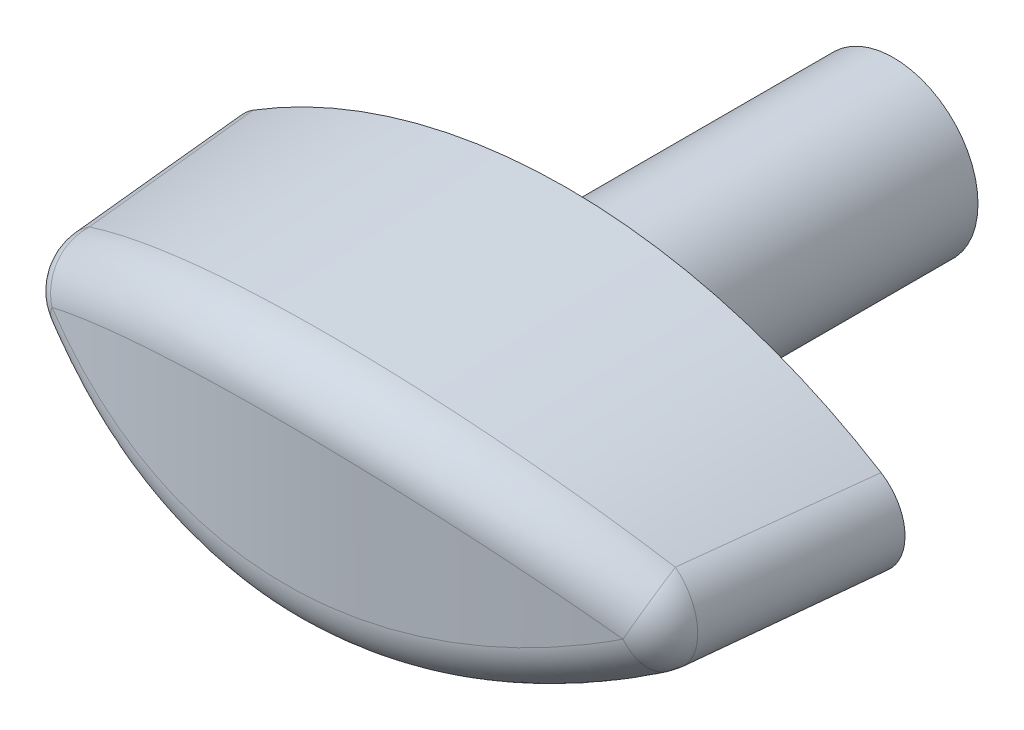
ISO-10303-21;
HEADER;
FILE_DESCRIPTION(('STEP AP214'),'2;1');
FILE_NAME('part.step','',(''),(''),'','','');
FILE_SCHEMA(('AUTOMOTIVE_DESIGN { 1 0 10303 214 1 1 1 1 }'));
ENDSEC;
DATA;
#1=APPLICATION_CONTEXT('core data for automotive mechanical design processes');
#2=APPLICATION_PROTOCOL_DEFINITION('international standard','automotive_design',2000,#1);
#3=PRODUCT_CONTEXT('',#1,'mechanical');
#4=PRODUCT('Part','Part','',(#3));
#5=PRODUCT_RELATED_PRODUCT_CATEGORY('part','',(#4));
#6=PRODUCT_DEFINITION_FORMATION('','',#4);
#7=PRODUCT_DEFINITION_CONTEXT('part definition',#1,'design');
#8=PRODUCT_DEFINITION('design','',#6,#7);
#9=PRODUCT_DEFINITION_SHAPE('','',#8);
#10=(LENGTH_UNIT() NAMED_UNIT(*) SI_UNIT(.MILLI.,.METRE.));
#11=(NAMED_UNIT(*) PLANE_ANGLE_UNIT() SI_UNIT($,.RADIAN.));
#12=(NAMED_UNIT(*) SI_UNIT($,.STERADIAN.) SOLID_ANGLE_UNIT());
#13=UNCERTAINTY_MEASURE_WITH_UNIT(LENGTH_MEASURE(1.E-05),#10,'distance_accuracy_value','');
#14=(GEOMETRIC_REPRESENTATION_CONTEXT(3) GLOBAL_UNCERTAINTY_ASSIGNED_CONTEXT((#13)) GLOBAL_UNIT_ASSIGNED_CONTEXT((#10,
#11,#12)) REPRESENTATION_CONTEXT('',''));
#15=CARTESIAN_POINT('',(0.,0.,0.));
#16=DIRECTION('',(0.,0.,1.));
#17=DIRECTION('',(1.,0.,0.));
#18=AXIS2_PLACEMENT_3D('',#15,#16,#17);
#19=CARTESIAN_POINT('',(-0.133482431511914,-27.3688144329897,0.4));
#20=DIRECTION('',(0.,0.,-1.));
#21=DIRECTION('',(1.,0.,0.));
#22=AXIS2_PLACEMENT_3D('',#19,#20,#21);
#23=CONICAL_SURFACE('',#22,35.2188144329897,0.05235987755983);
#24=CARTESIAN_POINT('',(-0.133482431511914,-27.3688144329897,0.4));
#25=DIRECTION('',(0.,0.,1.));
#26=DIRECTION('',(1.,0.,0.));
#27=AXIS2_PLACEMENT_3D('',#24,#25,#26);
#28=CIRCLE('',#27,35.2188144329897);
#29=CARTESIAN_POINT('',(18.455587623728,2.54458331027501,0.4));
#30=VERTEX_POINT('',#29);
#31=CARTESIAN_POINT('',(-18.7225524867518,2.54458331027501,0.4));
#32=VERTEX_POINT('',#31);
#33=EDGE_CURVE('E235',#30,#32,#28,.T.);
#34=ORIENTED_EDGE('',*,*,#33,.T.);
#35=CARTESIAN_POINT('',(-9.94764058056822,2.84937929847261,66.1700536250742));
#36=CARTESIAN_POINT('',(-11.9799614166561,2.17032947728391,66.5148628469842));
#37=CARTESIAN_POINT('',(-11.9799614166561,0.,66.5148628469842));
#38=CARTESIAN_POINT('',(-11.9799614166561,-2.1703294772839,66.5148628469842));
#39=CARTESIAN_POINT('',(-9.94764058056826,-2.84937929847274,66.1700536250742));
#40=CARTESIAN_POINT('',(-10.0634314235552,2.84614228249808,65.5462752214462));
#41=CARTESIAN_POINT('',(-12.0865456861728,2.1624595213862,65.8866121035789));
#42=CARTESIAN_POINT('',(-12.0866767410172,0.,65.8858334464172));
#43=CARTESIAN_POINT('',(-12.0865456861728,-2.16245952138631,65.8866121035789));
#44=CARTESIAN_POINT('',(-10.0634314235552,-2.84614228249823,65.5462752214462));
#45=CARTESIAN_POINT('',(-10.1773690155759,2.84291485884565,64.9222194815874));
#46=CARTESIAN_POINT('',(-12.1915627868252,2.15475428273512,65.2575420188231));
#47=CARTESIAN_POINT('',(-12.1916856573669,0.,65.2567934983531));
#48=CARTESIAN_POINT('',(-12.1915627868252,-2.15475428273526,65.2575420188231));
#49=CARTESIAN_POINT('',(-10.1773690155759,-2.84291485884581,64.9222194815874));
#50=CARTESIAN_POINT('',(-10.4018549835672,2.83647934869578,63.6736155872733));
#51=CARTESIAN_POINT('',(-12.3984693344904,2.13966577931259,63.9994335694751));
#52=CARTESIAN_POINT('',(-12.3985927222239,0.,63.9986847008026));
#53=CARTESIAN_POINT('',(-12.3984693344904,-2.13966577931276,63.9994335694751));
#54=CARTESIAN_POINT('',(-10.4018549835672,-2.83647934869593,63.6736155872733));
#55=CARTESIAN_POINT('',(-10.5124033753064,2.83327126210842,63.0490674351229));
#56=CARTESIAN_POINT('',(-12.5003766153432,2.13228099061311,63.3703319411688));
#57=CARTESIAN_POINT('',(-12.5004908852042,0.,63.3696158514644));
#58=CARTESIAN_POINT('',(-12.5003766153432,-2.13228099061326,63.3703319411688));
#59=CARTESIAN_POINT('',(-10.5124033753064,-2.83327126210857,63.0490674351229));
#60=CARTESIAN_POINT('',(-10.8394372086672,2.82367633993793,61.1747980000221));
#61=CARTESIAN_POINT('',(-12.8015122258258,2.1105902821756,61.4852332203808));
#62=CARTESIAN_POINT('',(-12.8019691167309,0.,61.4823746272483));
#63=CARTESIAN_POINT('',(-12.8015122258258,-2.11059028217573,61.4852332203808));
#64=CARTESIAN_POINT('',(-10.8394372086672,-2.82367633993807,61.1747980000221));
#65=CARTESIAN_POINT('',(-11.0513166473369,2.81731869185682,59.9244228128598));
#66=CARTESIAN_POINT('',(-12.9969375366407,2.09669040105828,60.2267788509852));
#67=CARTESIAN_POINT('',(-12.9973378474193,0.,60.2241384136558));
#68=CARTESIAN_POINT('',(-12.9969375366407,-2.09669040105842,60.2267788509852));
#69=CARTESIAN_POINT('',(-11.0513166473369,-2.81731869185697,59.9244228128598));
#70=CARTESIAN_POINT('',(-11.4647261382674,2.8046821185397,57.4223869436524));
#71=CARTESIAN_POINT('',(-13.3782702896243,2.06988168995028,57.7101943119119));
#72=CARTESIAN_POINT('',(-13.3786682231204,0.,57.7075667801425));
#73=CARTESIAN_POINT('',(-13.3782702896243,-2.06988168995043,57.7101943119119));
#74=CARTESIAN_POINT('',(-11.4647261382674,-2.80468211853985,57.4223869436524));
#75=CARTESIAN_POINT('',(-11.6662569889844,2.79840318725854,56.1707263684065));
#76=CARTESIAN_POINT('',(-13.5642765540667,2.05696454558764,56.4516773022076));
#77=CARTESIAN_POINT('',(-13.5646305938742,0.,56.4492313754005));
#78=CARTESIAN_POINT('',(-13.5642765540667,-2.0569645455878,56.4516773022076));
#79=CARTESIAN_POINT('',(-11.6662569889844,-2.79840318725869,56.1707263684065));
#80=CARTESIAN_POINT('',(-12.0604561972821,2.78592331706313,53.6662651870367));
#81=CARTESIAN_POINT('',(-13.9281862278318,2.03197951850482,53.9347762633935));
#82=CARTESIAN_POINT('',(-13.9285373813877,0.,53.9323448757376));
#83=CARTESIAN_POINT('',(-13.9281862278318,-2.03197951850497,53.9347762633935));
#84=CARTESIAN_POINT('',(-12.0604561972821,-2.78592331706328,53.6662651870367));
#85=CARTESIAN_POINT('',(-12.2531244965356,2.77972237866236,52.4134645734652));
#86=CARTESIAN_POINT('',(-14.1061688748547,2.01990506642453,52.6760596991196));
#87=CARTESIAN_POINT('',(-14.1064817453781,0.,52.6737937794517));
#88=CARTESIAN_POINT('',(-14.1061688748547,-2.01990506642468,52.6760596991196));
#89=CARTESIAN_POINT('',(-12.2531244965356,-2.77972237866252,52.4134645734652));
#90=CARTESIAN_POINT('',(-12.8195712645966,2.76123825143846,48.6541414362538));
#91=CARTESIAN_POINT('',(-14.6286414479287,1.98485174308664,48.9073744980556));
#92=CARTESIAN_POINT('',(-14.6299004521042,0.,48.8983113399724));
#93=CARTESIAN_POINT('',(-14.6286414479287,-1.98485174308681,48.9073744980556));
#94=CARTESIAN_POINT('',(-12.8195712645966,-2.76123825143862,48.6541414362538));
#95=CARTESIAN_POINT('',(-13.1818709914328,2.74907129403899,46.1462109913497));
#96=CARTESIAN_POINT('',(-14.963998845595,1.96287987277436,46.389071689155));
#97=CARTESIAN_POINT('',(-14.9650336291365,0.,46.3810615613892));
#98=CARTESIAN_POINT('',(-14.963998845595,-1.96287987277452,46.389071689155));
#99=CARTESIAN_POINT('',(-13.1818709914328,-2.74907129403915,46.1462109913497));
#100=CARTESIAN_POINT('',(-13.8826914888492,2.72504071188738,41.1276098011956));
#101=CARTESIAN_POINT('',(-15.6129960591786,1.92123528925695,41.353678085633));
#102=CARTESIAN_POINT('',(-15.6140160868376,0.,41.3457454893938));
#103=CARTESIAN_POINT('',(-15.6129960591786,-1.9212352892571,41.353678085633));
#104=CARTESIAN_POINT('',(-13.8826914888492,-2.72504071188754,41.1276098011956));
#105=CARTESIAN_POINT('',(-14.2212117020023,2.71317709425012,38.6169389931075));
#106=CARTESIAN_POINT('',(-15.9270018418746,1.9015334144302,38.8347968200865));
#107=CARTESIAN_POINT('',(-15.9278648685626,0.,38.8276791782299));
#108=CARTESIAN_POINT('',(-15.9270018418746,-1.90153341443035,38.8347968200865));
#109=CARTESIAN_POINT('',(-14.2212117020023,-2.71317709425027,38.6169389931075));
#110=CARTESIAN_POINT('',(-14.8789448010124,2.68974887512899,33.5943492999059));
#111=CARTESIAN_POINT('',(-16.5375019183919,1.86398835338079,33.7987360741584));
#112=CARTESIAN_POINT('',(-16.5383589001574,0.,33.7916652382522));
#113=CARTESIAN_POINT('',(-16.5375019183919,-1.86398835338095,33.7987360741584));
#114=CARTESIAN_POINT('',(-14.8789448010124,-2.68974887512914,33.5943492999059));
#115=CARTESIAN_POINT('',(-15.198163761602,2.67818418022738,31.0824310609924));
#116=CARTESIAN_POINT('',(-16.8342730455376,1.84612351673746,31.2801176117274));
#117=CARTESIAN_POINT('',(-16.8350095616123,0.,31.2737178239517));
#118=CARTESIAN_POINT('',(-16.8342730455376,-1.84612351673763,31.2801176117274));
#119=CARTESIAN_POINT('',(-15.198163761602,-2.67818418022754,31.0824310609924));
#120=CARTESIAN_POINT('',(-15.8207459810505,2.6553411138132,26.0570201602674));
#121=CARTESIAN_POINT('',(-17.4135109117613,1.81192131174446,26.2436110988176));
#122=CARTESIAN_POINT('',(-17.4142419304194,0.,26.2372505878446));
#123=CARTESIAN_POINT('',(-17.4135109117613,-1.81192131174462,26.2436110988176));
#124=CARTESIAN_POINT('',(-15.8207459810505,-2.65534111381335,26.0570201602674));
#125=CARTESIAN_POINT('',(-16.1241093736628,2.64406273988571,23.5435275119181));
#126=CARTESIAN_POINT('',(-17.6961864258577,1.79556816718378,23.7245322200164));
#127=CARTESIAN_POINT('',(-17.6968237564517,0.,23.7187307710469));
#128=CARTESIAN_POINT('',(-17.6961864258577,-1.79556816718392,23.7245322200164));
#129=CARTESIAN_POINT('',(-16.1241093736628,-2.64406273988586,23.5435275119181));
#130=CARTESIAN_POINT('',(-16.7174960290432,2.62178242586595,18.5151154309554));
#131=CARTESIAN_POINT('',(-18.2495558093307,1.76414591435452,18.6868014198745));
#132=CARTESIAN_POINT('',(-18.2501901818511,0.,18.6810256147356));
#133=CARTESIAN_POINT('',(-18.2495558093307,-1.76414591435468,18.6868014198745));
#134=CARTESIAN_POINT('',(-16.7174960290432,-2.62178242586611,18.5151154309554));
#135=CARTESIAN_POINT('',(-17.0075185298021,2.61078050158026,16.0001959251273));
#136=CARTESIAN_POINT('',(-18.5204137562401,1.74906476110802,16.1671467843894));
#137=CARTESIAN_POINT('',(-18.5209741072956,0.,16.161840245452));
#138=CARTESIAN_POINT('',(-18.5204137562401,-1.74906476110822,16.1671467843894));
#139=CARTESIAN_POINT('',(-17.007518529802,-2.61078050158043,16.0001959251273));
#140=CARTESIAN_POINT('',(-17.5761162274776,2.58904463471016,10.969297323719));
#141=CARTESIAN_POINT('',(-19.0518906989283,1.72000174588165,11.1282747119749));
#142=CARTESIAN_POINT('',(-19.0524458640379,0.,11.1230051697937));
#143=CARTESIAN_POINT('',(-19.0518906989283,-1.72000174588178,11.1282747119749));
#144=CARTESIAN_POINT('',(-17.5761162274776,-2.58904463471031,10.969297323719));
#145=CARTESIAN_POINT('',(-17.8546913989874,2.57831069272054,8.45331822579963));
#146=CARTESIAN_POINT('',(-19.3126426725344,1.70601035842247,8.60820031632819));
#147=CARTESIAN_POINT('',(-19.3131336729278,0.,8.60335546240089));
#148=CARTESIAN_POINT('',(-19.3126426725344,-1.7060103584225,8.60820031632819));
#149=CARTESIAN_POINT('',(-17.8546913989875,-2.57831069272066,8.45331822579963));
#150=CARTESIAN_POINT('',(-18.6754152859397,2.54650453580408,0.905774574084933));
#151=CARTESIAN_POINT('',(-20.0800124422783,1.66554621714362,1.06490118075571));
#152=CARTESIAN_POINT('',(-20.0819891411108,0.,1.0455066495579));
#153=CARTESIAN_POINT('',(-20.0800124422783,-1.66554621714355,1.06490118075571));
#154=CARTESIAN_POINT('',(-18.6754152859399,-2.54650453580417,0.905774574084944));
#155=CARTESIAN_POINT('',(-19.2027619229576,2.52582042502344,-4.12710669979));
#156=CARTESIAN_POINT('',(-20.5755333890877,1.64037213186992,-3.97658913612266));
#157=CARTESIAN_POINT('',(-20.5771350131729,0.,-3.9933054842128));
#158=CARTESIAN_POINT('',(-20.5755333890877,-1.64037213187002,-3.97658913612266));
#159=CARTESIAN_POINT('',(-19.2027619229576,-2.52582042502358,-4.12710669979));
#160=CARTESIAN_POINT('',(-20.2268944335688,2.4854191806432,-14.1952793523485));
#161=CARTESIAN_POINT('',(-21.5390704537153,1.59297490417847,-14.0555607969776));
#162=CARTESIAN_POINT('',(-21.5406472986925,-1.16511262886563E-13,-14.0720924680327));
#163=CARTESIAN_POINT('',(-21.5390704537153,-1.5929749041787,-14.0555607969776));
#164=CARTESIAN_POINT('',(-20.2268944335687,-2.48541918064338,-14.1952793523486));
#165=CARTESIAN_POINT('',(-20.7236810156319,2.46570202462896,-19.230570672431));
#166=CARTESIAN_POINT('',(-22.0076989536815,1.57071112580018,-19.0975815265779));
#167=CARTESIAN_POINT('',(-22.0090143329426,0.,-19.1120672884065));
#168=CARTESIAN_POINT('',(-22.0076989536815,-1.57071112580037,-19.0975815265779));
#169=CARTESIAN_POINT('',(-20.7236810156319,-2.46570202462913,-19.230570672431));
#170=CARTESIAN_POINT('',(-21.6928739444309,2.42716450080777,-29.3045674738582));
#171=CARTESIAN_POINT('',(-22.9231486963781,1.52853719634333,-29.1801362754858));
#172=CARTESIAN_POINT('',(-22.9244569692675,0.,-29.1945468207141));
#173=CARTESIAN_POINT('',(-22.9231486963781,-1.52853719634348,-29.1801362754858));
#174=CARTESIAN_POINT('',(-21.6928739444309,-2.42716450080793,-29.3045674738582));
#175=CARTESIAN_POINT('',(-22.1652730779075,2.40834439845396,-34.3432735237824));
#176=CARTESIAN_POINT('',(-23.3704165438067,1.50859917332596,-34.2242978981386));
#177=CARTESIAN_POINT('',(-23.3715262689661,0.,-34.2370518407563));
#178=CARTESIAN_POINT('',(-23.3704165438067,-1.50859917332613,-34.2242978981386));
#179=CARTESIAN_POINT('',(-22.1652730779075,-2.40834439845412,-34.3432735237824));
#180=CARTESIAN_POINT('',(-22.858760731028,2.38074702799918,-41.902509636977));
#181=CARTESIAN_POINT('',(-24.0286834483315,1.4801068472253,-41.7983357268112));
#182=CARTESIAN_POINT('',(-24.0289576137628,0.,-41.801497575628));
#183=CARTESIAN_POINT('',(-24.0286834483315,-1.48010684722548,-41.7983357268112));
#184=CARTESIAN_POINT('',(-22.858760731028,-2.38074702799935,-41.902509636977));
#185=CARTESIAN_POINT('',(-23.0874066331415,2.37165329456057,-44.42247237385));
#186=CARTESIAN_POINT('',(-24.2456523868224,1.47085913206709,-44.3201209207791));
#187=CARTESIAN_POINT('',(-24.2459077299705,0.,-44.3231153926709));
#188=CARTESIAN_POINT('',(-24.2456523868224,-1.47085913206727,-44.3201209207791));
#189=CARTESIAN_POINT('',(-23.0874066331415,-2.37165329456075,-44.42247237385));
#190=CARTESIAN_POINT('',(-23.5400779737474,2.35366995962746,-49.462737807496));
#191=CARTESIAN_POINT('',(-24.6755293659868,1.45280372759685,-49.3635662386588));
#192=CARTESIAN_POINT('',(-24.6757834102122,0.,-49.3665480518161));
#193=CARTESIAN_POINT('',(-24.6755293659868,-1.45280372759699,-49.3635662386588));
#194=CARTESIAN_POINT('',(-23.5400779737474,-2.35366995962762,-49.462737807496));
#195=CARTESIAN_POINT('',(-23.7641034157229,2.34478035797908,-51.9830405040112));
#196=CARTESIAN_POINT('',(-24.8884756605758,1.4439937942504,-51.8855627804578));
#197=CARTESIAN_POINT('',(-24.8887089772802,0.,-51.8883628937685));
#198=CARTESIAN_POINT('',(-24.8884756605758,-1.44399379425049,-51.8855627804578));
#199=CARTESIAN_POINT('',(-23.7641034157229,-2.34478035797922,-51.9830405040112));
#200=CARTESIAN_POINT('',(-23.9860278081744,2.33598938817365,-54.5034959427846));
#201=CARTESIAN_POINT('',(-25.0998062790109,1.43537470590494,-54.4102690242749));
#202=CARTESIAN_POINT('',(-25.0998062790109,0.,-54.4102690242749));
#203=CARTESIAN_POINT('',(-25.0998062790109,-1.43537470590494,-54.4102690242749));
#204=CARTESIAN_POINT('',(-23.9860278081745,-2.33598938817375,-54.5034959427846));
#205=(BOUNDED_SURFACE() B_SPLINE_SURFACE(3,2,((#35,#36,#37,#38,#39),(#40,#41,#42,#43,#44),(#45,
#46,#47,#48,#49),(#50,#51,#52,#53,#54),(#55,#56,#57,#58,#59),(#60,#61,#62,#63,#64),(#65,#66,#67,
#68,#69),(#70,#71,#72,#73,#74),(#75,#76,#77,#78,#79),(#80,#81,#82,#83,#84),(#85,#86,#87,#88,
#89),(#90,#91,#92,#93,#94),(#95,#96,#97,#98,#99),(#100,#101,#102,#103,#104),(#105,#106,#107,
#108,#109),(#110,#111,#112,#113,#114),(#115,#116,#117,#118,#119),(#120,#121,#122,#123,#124),
(#125,#126,#127,#128,#129),(#130,#131,#132,#133,#134),(#135,#136,#137,#138,#139),(#140,#141,
#142,#143,#144),(#145,#146,#147,#148,#149),(#150,#151,#152,#153,#154),(#155,#156,#157,#158,
#159),(#160,#161,#162,#163,#164),(#165,#166,#167,#168,#169),(#170,#171,#172,#173,#174),(#175,
#176,#177,#178,#179),(#180,#181,#182,#183,#184),(#185,#186,#187,#188,#189),(#190,#191,#192,#193,
#194),(#195,#196,#197,#198,#199),(#200,#201,#202,#203,#204)),.UNSPECIFIED.,.F.,.F.,
.F.) B_SPLINE_SURFACE_WITH_KNOTS((4,2,2,2,2,2,2,2,2,2,2,2,2,2,2,2,4),(3,2,3),(0.,
1.89806852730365,3.79612822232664,7.59215961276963,11.3878976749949,15.1836607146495,
22.7737107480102,30.3639386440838,37.9517650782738,45.5395274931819,53.1277227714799,
60.715934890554,75.8871979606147,91.0581091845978,106.233482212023,113.821296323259,
121.409104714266),(0.,0.5,1.),
.UNSPECIFIED.) GEOMETRIC_REPRESENTATION_ITEM() RATIONAL_B_SPLINE_SURFACE(((1.,0.810209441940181,
1.,0.810209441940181,1.),(1.,0.811220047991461,1.,0.811220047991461,1.),(1.,0.812208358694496,
1.,0.812208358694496,1.),(1.,0.814144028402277,1.,0.814144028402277,1.),(1.,0.815091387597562,
1.,0.815091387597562,1.),(1.,0.817877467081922,1.,0.817877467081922,1.),(1.,0.819660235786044,
1.,0.819660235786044,1.),(1.,0.823099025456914,1.,0.823099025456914,1.),(1.,0.824755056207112,
1.,0.824755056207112,1.),(1.,0.827957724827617,1.,0.827957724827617,1.),(1.,0.829504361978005,
1.,0.829504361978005,1.),(1.,0.834000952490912,1.,0.834000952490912,1.),(1.,0.836808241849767,
1.,0.836808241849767,1.),(1.,0.842123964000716,1.,0.842123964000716,1.),(1.,0.844632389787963,
1.,0.844632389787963,1.),(1.,0.849405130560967,1.,0.849405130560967,1.),(1.,0.85166952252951,1.,
0.85166952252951,1.),(1.,0.855995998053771,1.,0.855995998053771,1.),(1.,0.858058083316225,1.,
0.858058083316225,1.),(1.,0.86201098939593,1.,0.86201098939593,1.),(1.,0.86390180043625,1.,
0.86390180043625,1.),(1.,0.867535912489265,1.,0.867535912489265,1.),(1.,0.869279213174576,1.,
0.869279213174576,1.),(1.,0.874316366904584,1.,0.874316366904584,1.),(1.,0.877418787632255,1.,
0.877418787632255,1.),(1.,0.8832267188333,1.,0.8832267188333,1.),(1.,0.885932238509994,1.,
0.885932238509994,1.),(1.,0.89102494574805,1.,0.89102494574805,1.),(1.,0.893412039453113,1.,
0.893412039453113,1.),(1.,0.896796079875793,1.,0.896796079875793,1.),(1.,0.897891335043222,1.,
0.897891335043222,1.),(1.,0.900021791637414,1.,0.900021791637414,1.),(1.,0.901056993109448,1.,
0.901056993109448,1.),(1.,0.902064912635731,1.,0.902064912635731,1.))) REPRESENTATION_ITEM('') SURFACE());
#206=CARTESIAN_POINT('',(-23.9860278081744,2.33598938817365,-54.5034959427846));
#207=CARTESIAN_POINT('',(-23.7641034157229,2.34478035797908,-51.9830405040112));
#208=CARTESIAN_POINT('',(-23.5400779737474,2.35366995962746,-49.462737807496));
#209=CARTESIAN_POINT('',(-23.0874066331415,2.37165329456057,-44.42247237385));
#210=CARTESIAN_POINT('',(-22.858760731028,2.38074702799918,-41.902509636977));
#211=CARTESIAN_POINT('',(-22.1652730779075,2.40834439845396,-34.3432735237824));
#212=CARTESIAN_POINT('',(-21.6928739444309,2.42716450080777,-29.3045674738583));
#213=CARTESIAN_POINT('',(-20.7236810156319,2.46570202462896,-19.230570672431));
#214=CARTESIAN_POINT('',(-20.2268944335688,2.4854191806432,-14.1952793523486));
#215=CARTESIAN_POINT('',(-19.2027619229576,2.52582042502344,-4.12710669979));
#216=CARTESIAN_POINT('',(-18.6754152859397,2.54650453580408,0.90577457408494));
#217=CARTESIAN_POINT('',(-17.8546913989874,2.57831069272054,8.45331822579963));
#218=CARTESIAN_POINT('',(-17.5761162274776,2.58904463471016,10.969297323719));
#219=CARTESIAN_POINT('',(-17.0075185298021,2.61078050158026,16.0001959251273));
#220=CARTESIAN_POINT('',(-16.7174960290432,2.62178242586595,18.5151154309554));
#221=CARTESIAN_POINT('',(-16.1241093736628,2.64406273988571,23.5435275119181));
#222=CARTESIAN_POINT('',(-15.8207459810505,2.6553411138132,26.0570201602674));
#223=CARTESIAN_POINT('',(-15.198163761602,2.67818418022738,31.0824310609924));
#224=CARTESIAN_POINT('',(-14.8789448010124,2.68974887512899,33.5943492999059));
#225=CARTESIAN_POINT('',(-14.2212117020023,2.71317709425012,38.6169389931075));
#226=CARTESIAN_POINT('',(-13.8826914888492,2.72504071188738,41.1276098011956));
#227=CARTESIAN_POINT('',(-13.1818709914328,2.74907129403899,46.1462109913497));
#228=CARTESIAN_POINT('',(-12.8195712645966,2.76123825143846,48.6541414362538));
#229=CARTESIAN_POINT('',(-12.2531244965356,2.77972237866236,52.4134645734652));
#230=CARTESIAN_POINT('',(-12.0604561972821,2.78592331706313,53.6662651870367));
#231=CARTESIAN_POINT('',(-11.6662569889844,2.79840318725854,56.1707263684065));
#232=CARTESIAN_POINT('',(-11.4647261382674,2.8046821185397,57.4223869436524));
#233=CARTESIAN_POINT('',(-11.0513166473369,2.81731869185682,59.9244228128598));
#234=CARTESIAN_POINT('',(-10.8394372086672,2.82367633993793,61.1747980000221));
#235=CARTESIAN_POINT('',(-10.5124033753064,2.83327126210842,63.0490674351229));
#236=CARTESIAN_POINT('',(-10.4018549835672,2.83647934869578,63.6736155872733));
#237=CARTESIAN_POINT('',(-10.1773690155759,2.84291485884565,64.9222194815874));
#238=CARTESIAN_POINT('',(-10.0634314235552,2.84614228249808,65.5462752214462));
#239=CARTESIAN_POINT('',(-9.94764058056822,2.84937929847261,66.1700536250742));
#240=B_SPLINE_CURVE_WITH_KNOTS('',3,(#206,#207,#208,#209,#210,#211,#212,#213,#214,#215,#216,
#217,#218,#219,#220,#221,#222,#223,#224,#225,#226,#227,#228,#229,#230,#231,#232,#233,#234,#235,
#236,#237,#238,#239),.UNSPECIFIED.,.F.,.F.,(4,2,2,2,2,2,2,2,2,2,2,2,2,2,2,2,4),(0.,
7.58780839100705,15.1756225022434,30.3509955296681,45.5219067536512,60.6931698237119,
68.281381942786,75.869577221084,83.4573396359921,91.0451660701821,98.6353939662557,
106.225443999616,110.021207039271,113.816945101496,117.612976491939,119.511036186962,
121.409104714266),.UNSPECIFIED.);
#241=CARTESIAN_POINT('',(-17.5390517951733,2.5904405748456,11.2843807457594));
#242=VERTEX_POINT('',#241);
#243=EDGE_CURVE('E185',#32,#242,#240,.T.);
#244=ORIENTED_EDGE('',*,*,#243,.T.);
#245=CARTESIAN_POINT('',(-25.9116063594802,-6.5678676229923,9.45201347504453));
#246=CARTESIAN_POINT('',(-26.9623977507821,-5.22396085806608,8.77235175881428));
#247=CARTESIAN_POINT('',(-26.5522012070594,-4.61264985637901,7.09002431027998));
#248=CARTESIAN_POINT('',(-25.5819169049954,-6.22525334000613,9.66526230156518));
#249=CARTESIAN_POINT('',(-26.6372434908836,-4.84810499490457,8.99498365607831));
#250=CARTESIAN_POINT('',(-26.2149522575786,-4.23718862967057,7.28986126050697));
#251=CARTESIAN_POINT('',(-25.2442057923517,-5.8891721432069,9.8779192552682));
#252=CARTESIAN_POINT('',(-26.3045832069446,-4.4797963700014,9.21680138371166));
#253=CARTESIAN_POINT('',(-25.8694494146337,-3.86884377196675,7.48914356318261));
#254=CARTESIAN_POINT('',(-24.5528591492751,-5.23032017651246,10.3008712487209));
#255=CARTESIAN_POINT('',(-25.6221477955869,-3.75580524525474,9.65919199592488));
#256=CARTESIAN_POINT('',(-25.1620506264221,-3.14666241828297,7.88549480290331));
#257=CARTESIAN_POINT('',(-24.1992229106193,-4.90754999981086,10.5111661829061));
#258=CARTESIAN_POINT('',(-25.2722052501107,-3.40016897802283,9.87978368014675));
#259=CARTESIAN_POINT('',(-24.800153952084,-2.79282656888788,8.08256364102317));
#260=CARTESIAN_POINT('',(-23.1139686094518,-3.95902178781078,11.13710505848));
#261=CARTESIAN_POINT('',(-24.1918677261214,-2.3481514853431,10.5407319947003));
#262=CARTESIAN_POINT('',(-23.6893939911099,-1.75289230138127,8.6691352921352));
#263=CARTESIAN_POINT('',(-22.3586268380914,-3.35369283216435,11.5473966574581));
#264=CARTESIAN_POINT('',(-23.4385749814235,-1.67552627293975,10.9749701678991));
#265=CARTESIAN_POINT('',(-22.9160968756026,-1.08907596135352,9.05362238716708));
#266=CARTESIAN_POINT('',(-20.7818551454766,-2.19765537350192,12.346700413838));
#267=CARTESIAN_POINT('',(-21.8579618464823,-0.382152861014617,11.82673286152));
#268=CARTESIAN_POINT('',(-21.3014107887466,0.178913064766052,9.80265546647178));
#269=CARTESIAN_POINT('',(-19.9600203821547,-1.64733547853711,12.7355535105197));
#270=CARTESIAN_POINT('',(-21.029239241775,0.237229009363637,12.2437476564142));
#271=CARTESIAN_POINT('',(-20.4596044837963,0.782661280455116,10.1670523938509));
#272=CARTESIAN_POINT('',(-18.2575571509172,-0.610848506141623,13.4796245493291));
#273=CARTESIAN_POINT('',(-19.302109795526,1.41287325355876,13.0479460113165));
#274=CARTESIAN_POINT('',(-18.715340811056,1.91998638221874,10.8643265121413));
#275=CARTESIAN_POINT('',(-17.3769597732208,-0.124647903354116,13.834860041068));
#276=CARTESIAN_POINT('',(-18.4031396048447,1.96785628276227,13.4344551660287));
#277=CARTESIAN_POINT('',(-17.8129155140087,2.45359993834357,11.1972201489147));
#278=CARTESIAN_POINT('',(-15.7351261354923,0.691442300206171,14.4386374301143));
#279=CARTESIAN_POINT('',(-16.7179486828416,2.90601325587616,14.0960791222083));
#280=CARTESIAN_POINT('',(-16.1300201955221,3.34941894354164,11.7630241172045));
#281=CARTESIAN_POINT('',(-14.9834257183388,1.03342158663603,14.6945703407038));
#282=CARTESIAN_POINT('',(-15.9413192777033,3.3018014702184,14.3784810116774));
#283=CARTESIAN_POINT('',(-15.3593923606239,3.72486502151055,12.002860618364));
#284=CARTESIAN_POINT('',(-13.4470034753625,1.66864621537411,15.1740241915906));
#285=CARTESIAN_POINT('',(-14.3447208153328,4.04212002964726,14.9112368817));
#286=CARTESIAN_POINT('',(-13.7840433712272,4.42233580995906,12.4521601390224));
#287=CARTESIAN_POINT('',(-12.6622879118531,1.96190074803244,15.3975512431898));
#288=CARTESIAN_POINT('',(-13.5251739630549,4.38565861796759,15.1609311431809));
#289=CARTESIAN_POINT('',(-12.9793286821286,4.74437059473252,12.6616288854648));
#290=CARTESIAN_POINT('',(-11.0663718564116,2.49543766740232,15.8071244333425));
#291=CARTESIAN_POINT('',(-11.8487521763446,5.0150093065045,15.6216067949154));
#292=CARTESIAN_POINT('',(-11.3425277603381,5.33032755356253,13.0454427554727));
#293=CARTESIAN_POINT('',(-10.255274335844,2.73590291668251,15.993299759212));
#294=CARTESIAN_POINT('',(-10.9928496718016,5.29998469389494,15.8319990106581));
#295=CARTESIAN_POINT('',(-10.5105478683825,5.59445033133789,13.2199089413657));
#296=CARTESIAN_POINT('',(-8.6088043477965,3.16197518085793,16.3252089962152));
#297=CARTESIAN_POINT('',(-9.24591509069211,5.80822566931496,16.2094862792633));
#298=CARTESIAN_POINT('',(-8.82151313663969,6.06247820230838,13.5309433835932));
#299=CARTESIAN_POINT('',(-7.77343736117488,3.34759447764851,16.4709519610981));
#300=CARTESIAN_POINT('',(-8.35623326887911,6.03049926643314,16.375865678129));
#301=CARTESIAN_POINT('',(-7.96446395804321,6.26639677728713,13.6675201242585));
#302=CARTESIAN_POINT('',(-6.30456128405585,3.62036059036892,16.6864405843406));
#303=CARTESIAN_POINT('',(-6.78569450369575,6.35873278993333,16.6229913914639));
#304=CARTESIAN_POINT('',(-6.45734742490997,6.56607248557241,13.8694560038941));
#305=CARTESIAN_POINT('',(-5.67521841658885,3.7205637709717,16.7660933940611));
#306=CARTESIAN_POINT('',(-6.11075264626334,6.47970396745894,16.7146060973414));
#307=CARTESIAN_POINT('',(-5.81158450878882,6.67616820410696,13.9440992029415));
#308=CARTESIAN_POINT('',(-4.40886396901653,3.88868776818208,16.9005531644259));
#309=CARTESIAN_POINT('',(-4.74888712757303,6.68337557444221,16.8697106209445));
#310=CARTESIAN_POINT('',(-4.51213654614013,6.86089822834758,14.0701023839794));
#311=CARTESIAN_POINT('',(-3.77185121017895,3.95660355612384,16.9553562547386));
#312=CARTESIAN_POINT('',(-4.06281663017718,6.76579746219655,16.9329921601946));
#313=CARTESIAN_POINT('',(-3.85845028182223,6.93552701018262,14.1214587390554));
#314=CARTESIAN_POINT('',(-2.49262969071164,4.0595240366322,17.0393945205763));
#315=CARTESIAN_POINT('',(-2.6822628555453,6.89108237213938,17.0301954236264));
#316=CARTESIAN_POINT('',(-2.54571236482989,7.04862641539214,14.2002115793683));
#317=CARTESIAN_POINT('',(-1.85041735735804,4.09450374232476,17.0686102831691));
#318=CARTESIAN_POINT('',(-1.98872288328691,6.93373781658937,17.063960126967));
#319=CARTESIAN_POINT('',(-1.88665702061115,7.08706958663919,14.2275898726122));
#320=CARTESIAN_POINT('',(-0.564408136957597,4.13112920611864,17.1010243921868));
#321=CARTESIAN_POINT('',(-0.598226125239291,6.97862079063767,17.1013373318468));
#322=CARTESIAN_POINT('',(-0.566907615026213,7.12733004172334,14.2579653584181));
#323=CARTESIAN_POINT('',(0.0793884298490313,4.13278122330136,17.1042276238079));
#324=CARTESIAN_POINT('',(0.0977321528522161,6.98078942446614,17.1049030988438));
#325=CARTESIAN_POINT('',(0.0937861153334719,7.12915420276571,14.2609671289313));
#326=CARTESIAN_POINT('',(1.57701571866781,4.09777629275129,17.0813510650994));
#327=CARTESIAN_POINT('',(1.71713036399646,6.93858223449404,17.0779434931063));
#328=CARTESIAN_POINT('',(1.63071048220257,7.09071283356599,14.2395293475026));
#329=CARTESIAN_POINT('',(2.43040750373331,4.048363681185,17.0453117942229));
#330=CARTESIAN_POINT('',(2.63838773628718,6.87879894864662,17.035916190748));
#331=CARTESIAN_POINT('',(2.50648743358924,7.03643179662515,14.2057566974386));
#332=CARTESIAN_POINT('',(4.12803164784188,3.89140741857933,16.9281394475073));
#333=CARTESIAN_POINT('',(4.46966477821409,6.68874417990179,16.8996130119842));
#334=CARTESIAN_POINT('',(4.24857850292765,6.86400449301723,14.0959536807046));
#335=CARTESIAN_POINT('',(4.97226212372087,3.78385203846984,16.846997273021));
#336=CARTESIAN_POINT('',(5.37748567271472,6.5589210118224,16.8056638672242));
#337=CARTESIAN_POINT('',(5.11489067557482,6.74584534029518,14.0199147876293));
#338=CARTESIAN_POINT('',(6.64527404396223,3.51223605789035,16.6415410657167));
#339=CARTESIAN_POINT('',(7.17264885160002,6.23160893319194,16.5683895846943));
#340=CARTESIAN_POINT('',(6.83155366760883,6.44746416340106,13.8273803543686));
#341=CARTESIAN_POINT('',(7.47404940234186,3.34815367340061,16.5172103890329));
#342=CARTESIAN_POINT('',(8.05810540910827,6.03483393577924,16.4255836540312));
#343=CARTESIAN_POINT('',(7.68189820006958,6.26721821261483,13.7108692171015));
#344=CARTESIAN_POINT('',(9.10997409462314,2.96588856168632,16.228232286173));
#345=CARTESIAN_POINT('',(9.80010659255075,5.57782829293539,16.0948656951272));
#346=CARTESIAN_POINT('',(9.36024997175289,5.84732885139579,13.440065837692));
#347=CARTESIAN_POINT('',(9.91712421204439,2.74770779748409,16.0635863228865));
#348=CARTESIAN_POINT('',(10.6551942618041,5.31851951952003,15.9076146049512));
#349=CARTESIAN_POINT('',(10.1882580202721,5.60768759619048,13.2857749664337));
#350=CARTESIAN_POINT('',(11.5001483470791,2.26158364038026,15.698605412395));
#351=CARTESIAN_POINT('',(12.325250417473,4.74312513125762,15.4943867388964));
#352=CARTESIAN_POINT('',(11.8120079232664,5.07380137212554,12.9437488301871));
#353=CARTESIAN_POINT('',(12.2761816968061,1.99394845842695,15.498491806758));
#354=CARTESIAN_POINT('',(13.1393982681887,4.42838600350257,15.2693460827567));
#355=CARTESIAN_POINT('',(12.6079143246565,4.77989460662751,12.7562209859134));
#356=CARTESIAN_POINT('',(13.7982069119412,1.41110283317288,15.0658337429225));
#357=CARTESIAN_POINT('',(14.7286390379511,3.74621355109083,14.785275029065));
#358=CARTESIAN_POINT('',(14.1687093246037,4.13991192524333,12.3507741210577));
#359=CARTESIAN_POINT('',(14.5441984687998,1.09589190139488,14.8332889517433));
#360=CARTESIAN_POINT('',(15.5031761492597,3.37973795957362,14.5268890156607));
#361=CARTESIAN_POINT('',(14.9335976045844,3.79383547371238,12.1328547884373));
#362=CARTESIAN_POINT('',(16.0041198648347,0.420489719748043,14.3396389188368));
#363=CARTESIAN_POINT('',(17.011391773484,2.59848218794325,13.9813573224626));
#364=CARTESIAN_POINT('',(16.4302731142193,3.05239823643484,11.6702519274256));
#365=CARTESIAN_POINT('',(16.7180038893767,0.0602368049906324,14.0784945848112));
#366=CARTESIAN_POINT('',(17.744838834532,2.1845075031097,13.6947250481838));
#367=CARTESIAN_POINT('',(17.1620130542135,2.65696988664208,11.4255317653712));
#368=CARTESIAN_POINT('',(18.1103887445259,-0.702021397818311,13.5322812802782));
#369=CARTESIAN_POINT('',(19.1681779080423,1.31310015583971,13.0985006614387));
#370=CARTESIAN_POINT('',(18.5889836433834,1.82040931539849,10.9136714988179));
#371=CARTESIAN_POINT('',(18.7888850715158,-1.10403198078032,13.2472092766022));
#372=CARTESIAN_POINT('',(19.858181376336,0.856413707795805,12.7893404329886));
#373=CARTESIAN_POINT('',(19.2842096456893,1.37927129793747,10.6465285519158));
#374=CARTESIAN_POINT('',(20.180050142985,-1.99270985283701,12.6257896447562));
#375=CARTESIAN_POINT('',(21.2651061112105,-0.147392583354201,12.1194752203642));
#376=CARTESIAN_POINT('',(20.7094147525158,0.40425646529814,10.0641919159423));
#377=CARTESIAN_POINT('',(20.8884918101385,-2.48383094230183,12.2872296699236));
#378=CARTESIAN_POINT('',(21.9783423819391,-0.698893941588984,11.7567128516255));
#379=CARTESIAN_POINT('',(21.4350342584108,-0.134490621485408,9.74692502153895));
#380=CARTESIAN_POINT('',(22.2581097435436,-3.51104785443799,11.5924805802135));
#381=CARTESIAN_POINT('',(23.3501431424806,-1.84635337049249,11.0165060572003));
#382=CARTESIAN_POINT('',(22.8375560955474,-1.26110529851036,9.09587084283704));
#383=CARTESIAN_POINT('',(22.9192773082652,-4.04715191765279,11.2362882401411));
#384=CARTESIAN_POINT('',(24.0094060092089,-2.44172722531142,10.6392571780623));
#385=CARTESIAN_POINT('',(23.5144494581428,-1.84898188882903,8.76208053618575));
#386=CARTESIAN_POINT('',(24.1901225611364,-5.15942046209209,10.5143171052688));
#387=CARTESIAN_POINT('',(25.2705873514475,-3.67100849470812,9.87861765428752));
#388=CARTESIAN_POINT('',(24.8152229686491,-3.06842039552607,8.08551639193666));
#389=CARTESIAN_POINT('',(24.8000152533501,-5.73539707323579,10.14858773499));
#390=CARTESIAN_POINT('',(25.8735557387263,-4.30432956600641,9.49528806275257));
#391=CARTESIAN_POINT('',(25.4393245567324,-3.69977737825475,7.74278887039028));
#392=CARTESIAN_POINT('',(25.6774596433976,-6.62935820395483,9.59687294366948));
#393=CARTESIAN_POINT('',(26.7399086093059,-5.28595217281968,8.91806966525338));
#394=CARTESIAN_POINT('',(26.3369990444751,-4.67949322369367,7.22577312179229));
#395=CARTESIAN_POINT('',(25.9636668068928,-6.93229487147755,9.41247698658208));
#396=CARTESIAN_POINT('',(27.0211487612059,-5.61684324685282,8.72617592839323));
#397=CARTESIAN_POINT('',(26.6297680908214,-5.01145740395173,7.05297439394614));
#398=CARTESIAN_POINT('',(26.5235329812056,-7.54808714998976,9.04349060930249));
#399=CARTESIAN_POINT('',(27.5702389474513,-6.28804341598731,8.34306309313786));
#400=CARTESIAN_POINT('',(27.2024007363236,-5.68618709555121,6.7071947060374));
#401=CARTESIAN_POINT('',(26.7971919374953,-7.86094280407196,8.85890018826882));
#402=CARTESIAN_POINT('',(27.8382072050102,-6.62834466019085,8.15181272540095));
#403=CARTESIAN_POINT('',(27.482264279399,-6.02895265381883,6.53421374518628));
#404=CARTESIAN_POINT('',(27.0645147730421,-8.17870433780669,8.67464549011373));
#405=CARTESIAN_POINT('',(28.1002567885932,-6.97430695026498,7.96076026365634));
#406=CARTESIAN_POINT('',(27.7556144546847,-6.37705778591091,6.36154739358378));
#407=(BOUNDED_SURFACE() B_SPLINE_SURFACE(3,2,((#245,#246,#247),(#248,#249,#250),(#251,#252,
#253),(#254,#255,#256),(#257,#258,#259),(#260,#261,#262),(#263,#264,#265),(#266,#267,#268),
(#269,#270,#271),(#272,#273,#274),(#275,#276,#277),(#278,#279,#280),(#281,#282,#283),(#284,#285,
#286),(#287,#288,#289),(#290,#291,#292),(#293,#294,#295),(#296,#297,#298),(#299,#300,#301),
(#302,#303,#304),(#305,#306,#307),(#308,#309,#310),(#311,#312,#313),(#314,#315,#316),(#317,#318,
#319),(#320,#321,#322),(#323,#324,#325),(#326,#327,#328),(#329,#330,#331),(#332,#333,#334),
(#335,#336,#337),(#338,#339,#340),(#341,#342,#343),(#344,#345,#346),(#347,#348,#349),(#350,#351,
#352),(#353,#354,#355),(#356,#357,#358),(#359,#360,#361),(#362,#363,#364),(#365,#366,#367),
(#368,#369,#370),(#371,#372,#373),(#374,#375,#376),(#377,#378,#379),(#380,#381,#382),(#383,#384,
#385),(#386,#387,#388),(#389,#390,#391),(#392,#393,#394),(#395,#396,#397),(#398,#399,#400),
(#401,#402,#403),(#404,#405,#406)),.UNSPECIFIED.,.F.,.F.,.F.) B_SPLINE_SURFACE_WITH_KNOTS((4,2,
2,2,2,2,2,2,2,2,2,2,2,2,2,2,2,2,2,2,2,2,2,2,2,2,4),(3,3),(0.,1.50808420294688,3.01623553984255,
6.03538065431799,9.07453624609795,12.1120964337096,14.5665723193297,17.0205847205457,
19.4659573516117,21.9107819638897,23.7180809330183,25.5256612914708,27.334611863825,
29.1432227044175,31.5456360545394,33.9485342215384,36.3523594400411,38.7560974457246,
41.1453313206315,43.5345897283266,45.9271557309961,48.320025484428,50.9714043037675,
53.6232699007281,56.2633947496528,57.5830442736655,58.9026995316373),(0.,1.),
.UNSPECIFIED.) GEOMETRIC_REPRESENTATION_ITEM() RATIONAL_B_SPLINE_SURFACE(((1.,0.852899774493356,
1.),(1.,0.849934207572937,1.),(1.,0.846933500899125,1.),(1.,0.840878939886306,1.),(1.,
0.837825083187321,1.),(1.,0.82860410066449,1.),(1.,0.822383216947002,1.),(1.,0.809927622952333,
1.),(1.,0.803693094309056,1.),(1.,0.791454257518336,1.),(1.,0.785449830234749,1.),(1.,
0.775008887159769,1.),(1.,0.770492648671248,1.),(1.,0.761892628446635,1.),(1.,0.757808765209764,
1.),(1.,0.750222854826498,1.),(1.,0.746718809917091,1.),(1.,0.740406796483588,1.),(1.,
0.737598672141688,1.),(1.,0.733419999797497,1.),(1.,0.731865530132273,1.),(1.,0.7292361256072,
1.),(1.,0.728161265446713,1.),(1.,0.726518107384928,1.),(1.,0.725950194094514,1.),(1.,
0.725336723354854,1.),(1.,0.72529106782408,1.),(1.,0.725794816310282,1.),(1.,0.726544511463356,
1.),(1.,0.728935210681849,1.),(1.,0.730576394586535,1.),(1.,0.734678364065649,1.),(1.,
0.737139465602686,1.),(1.,0.742779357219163,1.),(1.,0.745958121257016,1.),(1.,0.752892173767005,
1.),(1.,0.756643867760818,1.),(1.,0.764611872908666,1.),(1.,0.768828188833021,1.),(1.,
0.777606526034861,1.),(1.,0.782169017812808,1.),(1.,0.791516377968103,1.),(1.,0.796301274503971,
1.),(1.,0.80650787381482,1.),(1.,0.811942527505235,1.),(1.,0.822820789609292,1.),(1.,
0.828264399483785,1.),(1.,0.839022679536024,1.),(1.,0.844337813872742,1.),(1.,0.852156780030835,
1.),(1.,0.854737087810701,1.),(1.,0.859836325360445,1.),(1.,0.862355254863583,1.),(1.,
0.864838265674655,1.))) REPRESENTATION_ITEM('') SURFACE());
#408=CARTESIAN_POINT('',(-26.5522012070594,-4.61264985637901,7.09002431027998));
#409=CARTESIAN_POINT('',(-26.2149522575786,-4.23718862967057,7.28986126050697));
#410=CARTESIAN_POINT('',(-25.8694494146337,-3.86884377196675,7.48914356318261));
#411=CARTESIAN_POINT('',(-25.1620506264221,-3.14666241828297,7.88549480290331));
#412=CARTESIAN_POINT('',(-24.800153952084,-2.79282656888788,8.08256364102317));
#413=CARTESIAN_POINT('',(-23.6893939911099,-1.75289230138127,8.6691352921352));
#414=CARTESIAN_POINT('',(-22.9160968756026,-1.08907596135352,9.05362238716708));
#415=CARTESIAN_POINT('',(-21.3014107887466,0.178913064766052,9.80265546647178));
#416=CARTESIAN_POINT('',(-20.4596044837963,0.782661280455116,10.1670523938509));
#417=CARTESIAN_POINT('',(-18.715340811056,1.91998638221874,10.8643265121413));
#418=CARTESIAN_POINT('',(-17.8129155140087,2.45359993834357,11.1972201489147));
#419=CARTESIAN_POINT('',(-16.1300201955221,3.34941894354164,11.7630241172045));
#420=CARTESIAN_POINT('',(-15.3593923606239,3.72486502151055,12.002860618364));
#421=CARTESIAN_POINT('',(-13.7840433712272,4.42233580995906,12.4521601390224));
#422=CARTESIAN_POINT('',(-12.9793286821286,4.74437059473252,12.6616288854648));
#423=CARTESIAN_POINT('',(-11.3425277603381,5.33032755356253,13.0454427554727));
#424=CARTESIAN_POINT('',(-10.5105478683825,5.59445033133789,13.2199089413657));
#425=CARTESIAN_POINT('',(-8.82151313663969,6.06247820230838,13.5309433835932));
#426=CARTESIAN_POINT('',(-7.96446395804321,6.26639677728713,13.6675201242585));
#427=CARTESIAN_POINT('',(-6.45734742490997,6.56607248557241,13.8694560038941));
#428=CARTESIAN_POINT('',(-5.81158450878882,6.67616820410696,13.9440992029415));
#429=CARTESIAN_POINT('',(-4.51213654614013,6.86089822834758,14.0701023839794));
#430=CARTESIAN_POINT('',(-3.85845028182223,6.93552701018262,14.1214587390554));
#431=CARTESIAN_POINT('',(-2.54571236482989,7.04862641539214,14.2002115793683));
#432=CARTESIAN_POINT('',(-1.88665702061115,7.08706958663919,14.2275898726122));
#433=CARTESIAN_POINT('',(-0.566907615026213,7.12733004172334,14.2579653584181));
#434=CARTESIAN_POINT('',(0.0937861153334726,7.12915420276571,14.2609671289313));
#435=CARTESIAN_POINT('',(1.63071048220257,7.09071283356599,14.2395293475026));
#436=CARTESIAN_POINT('',(2.50648743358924,7.03643179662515,14.2057566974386));
#437=CARTESIAN_POINT('',(4.24857850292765,6.86400449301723,14.0959536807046));
#438=CARTESIAN_POINT('',(5.11489067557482,6.74584534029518,14.0199147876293));
#439=CARTESIAN_POINT('',(6.83155366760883,6.44746416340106,13.8273803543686));
#440=CARTESIAN_POINT('',(7.68189820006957,6.26721821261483,13.7108692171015));
#441=CARTESIAN_POINT('',(9.36024997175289,5.84732885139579,13.440065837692));
#442=CARTESIAN_POINT('',(10.1882580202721,5.60768759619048,13.2857749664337));
#443=CARTESIAN_POINT('',(11.8120079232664,5.07380137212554,12.9437488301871));
#444=CARTESIAN_POINT('',(12.6079143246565,4.77989460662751,12.7562209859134));
#445=CARTESIAN_POINT('',(14.1687093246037,4.13991192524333,12.3507741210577));
#446=CARTESIAN_POINT('',(14.9335976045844,3.79383547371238,12.1328547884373));
#447=CARTESIAN_POINT('',(16.4302731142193,3.05239823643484,11.6702519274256));
#448=CARTESIAN_POINT('',(17.1620130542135,2.65696988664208,11.4255317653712));
#449=CARTESIAN_POINT('',(18.5889836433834,1.82040931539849,10.9136714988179));
#450=CARTESIAN_POINT('',(19.2842096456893,1.37927129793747,10.6465285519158));
#451=CARTESIAN_POINT('',(20.7094147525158,0.404256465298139,10.0641919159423));
#452=CARTESIAN_POINT('',(21.4350342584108,-0.134490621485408,9.74692502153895));
#453=CARTESIAN_POINT('',(22.8375560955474,-1.26110529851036,9.09587084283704));
#454=CARTESIAN_POINT('',(23.5144494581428,-1.84898188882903,8.76208053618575));
#455=CARTESIAN_POINT('',(24.8152229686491,-3.06842039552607,8.08551639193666));
#456=CARTESIAN_POINT('',(25.4393245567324,-3.69977737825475,7.74278887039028));
#457=CARTESIAN_POINT('',(26.3369990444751,-4.67949322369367,7.22577312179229));
#458=CARTESIAN_POINT('',(26.6297680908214,-5.01145740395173,7.05297439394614));
#459=CARTESIAN_POINT('',(27.2024007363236,-5.68618709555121,6.7071947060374));
#460=CARTESIAN_POINT('',(27.482264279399,-6.02895265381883,6.53421374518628));
#461=CARTESIAN_POINT('',(27.7556144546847,-6.37705778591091,6.36154739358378));
#462=B_SPLINE_CURVE_WITH_KNOTS('',3,(#408,#409,#410,#411,#412,#413,#414,#415,#416,#417,#418,
#419,#420,#421,#422,#423,#424,#425,#426,#427,#428,#429,#430,#431,#432,#433,#434,#435,#436,#437,
#438,#439,#440,#441,#442,#443,#444,#445,#446,#447,#448,#449,#450,#451,#452,#453,#454,#455,#456,
#457,#458,#459,#460,#461),.UNSPECIFIED.,.F.,.F.,(4,2,2,2,2,2,2,2,2,2,2,2,2,2,2,2,2,2,2,2,2,2,2,
2,2,2,4),(0.,1.50808420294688,3.01623553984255,6.03538065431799,9.07453624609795,
12.1120964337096,14.5665723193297,17.0205847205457,19.4659573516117,21.9107819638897,
23.7180809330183,25.5256612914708,27.334611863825,29.1432227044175,31.5456360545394,
33.9485342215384,36.3523594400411,38.7560974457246,41.1453313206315,43.5345897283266,
45.9271557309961,48.320025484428,50.9714043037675,53.6232699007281,56.2633947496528,
57.5830442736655,58.9026995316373),.UNSPECIFIED.);
#463=CARTESIAN_POINT('',(17.2607608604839,2.59087539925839,11.3857437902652));
#464=VERTEX_POINT('',#463);
#465=EDGE_CURVE('E72',#242,#464,#462,.T.);
#466=ORIENTED_EDGE('',*,*,#465,.T.);
#467=CARTESIAN_POINT('',(9.66971649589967,-2.84968552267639,66.2290571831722));
#468=CARTESIAN_POINT('',(11.7028962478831,-2.17107541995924,66.5743641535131));
#469=CARTESIAN_POINT('',(11.7028962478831,0.,66.5743641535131));
#470=CARTESIAN_POINT('',(11.7028962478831,2.17107541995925,66.5743641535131));
#471=CARTESIAN_POINT('',(9.66971649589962,2.84968552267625,66.2290571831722));
#472=CARTESIAN_POINT('',(9.78561316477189,-2.84644824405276,65.6053622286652));
#473=CARTESIAN_POINT('',(11.8095777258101,-2.16319517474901,65.9461812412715));
#474=CARTESIAN_POINT('',(11.8097090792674,0.,65.9454015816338));
#475=CARTESIAN_POINT('',(11.8095777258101,2.16319517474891,65.9461812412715));
#476=CARTESIAN_POINT('',(9.78561316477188,2.84644824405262,65.6053622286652));
#477=CARTESIAN_POINT('',(9.89965101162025,-2.84322055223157,64.9813888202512));
#478=CARTESIAN_POINT('',(11.9146870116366,-2.15548013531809,65.3171781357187));
#479=CARTESIAN_POINT('',(11.9148101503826,0.,65.3164286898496));
#480=CARTESIAN_POINT('',(11.9146870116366,2.15548013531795,65.3171781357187));
#481=CARTESIAN_POINT('',(9.89965101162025,2.84322055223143,64.9813888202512));
#482=CARTESIAN_POINT('',(10.1243278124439,-2.83678449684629,63.7329477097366));
#483=CARTESIAN_POINT('',(12.1217686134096,-2.14037293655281,64.0592041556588));
#484=CARTESIAN_POINT('',(12.121892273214,0.,64.0584543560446));
#485=CARTESIAN_POINT('',(12.1217686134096,2.14037293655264,64.0592041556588));
#486=CARTESIAN_POINT('',(10.1243278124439,2.83678449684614,63.7329477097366));
#487=CARTESIAN_POINT('',(10.2349667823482,-2.83357613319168,63.1084800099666));
#488=CARTESIAN_POINT('',(12.2237588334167,-2.13297924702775,63.4301698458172));
#489=CARTESIAN_POINT('',(12.2238733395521,0.,63.4294529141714));
#490=CARTESIAN_POINT('',(12.2237588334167,2.13297924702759,63.4301698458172));
#491=CARTESIAN_POINT('',(10.2349667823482,2.83357613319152,63.1084800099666));
#492=CARTESIAN_POINT('',(10.5622600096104,-2.82398037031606,61.2344497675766));
#493=CARTESIAN_POINT('',(12.5251307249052,-2.11126305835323,61.5452763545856));
#494=CARTESIAN_POINT('',(12.5255885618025,0.,61.5424144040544));
#495=CARTESIAN_POINT('',(12.5251307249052,2.11126305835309,61.5452763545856));
#496=CARTESIAN_POINT('',(10.5622600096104,2.8239803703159,61.2344497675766));
#497=CARTESIAN_POINT('',(10.7742959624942,-2.81762214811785,59.9842309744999));
#498=CARTESIAN_POINT('',(12.720698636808,-2.09734766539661,60.2869570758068));
#499=CARTESIAN_POINT('',(12.7210996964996,0.,60.2843138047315));
#500=CARTESIAN_POINT('',(12.720698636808,2.09734766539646,60.2869570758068));
#501=CARTESIAN_POINT('',(10.7742959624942,2.8176221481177,59.9842309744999));
#502=CARTESIAN_POINT('',(11.1879936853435,-2.80498441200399,57.4825039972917));
#503=CARTESIAN_POINT('',(13.1022928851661,-2.070510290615,57.7706446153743));
#504=CARTESIAN_POINT('',(13.1026915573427,0.,57.7680142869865));
#505=CARTESIAN_POINT('',(13.1022928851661,2.07051029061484,57.7706446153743));
#506=CARTESIAN_POINT('',(11.1879936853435,2.80498441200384,57.4825039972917));
#507=CARTESIAN_POINT('',(11.389656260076,-2.79870489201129,56.23099592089));
#508=CARTESIAN_POINT('',(13.2884183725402,-2.05757996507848,56.5122637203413));
#509=CARTESIAN_POINT('',(13.2887730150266,0.,56.5098153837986));
#510=CARTESIAN_POINT('',(13.2884183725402,2.05757996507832,56.5122637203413));
#511=CARTESIAN_POINT('',(11.389656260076,2.79870489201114,56.23099592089));
#512=CARTESIAN_POINT('',(11.7840997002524,-2.78622383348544,53.7268364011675));
#513=CARTESIAN_POINT('',(13.652548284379,-2.03257041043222,53.9956357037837));
#514=CARTESIAN_POINT('',(13.6529000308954,0.,53.9932019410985));
#515=CARTESIAN_POINT('',(13.652548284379,2.03257041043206,53.9956357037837));
#516=CARTESIAN_POINT('',(11.7840997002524,2.78622383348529,53.7268364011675));
#517=CARTESIAN_POINT('',(11.976880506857,-2.7800222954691,52.4741849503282));
#518=CARTESIAN_POINT('',(13.830632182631,-2.02048459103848,52.7370553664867));
#519=CARTESIAN_POINT('',(13.830945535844,0.,52.7347874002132));
#520=CARTESIAN_POINT('',(13.830632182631,2.02048459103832,52.7370553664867));
#521=CARTESIAN_POINT('',(11.976880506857,2.78002229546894,52.4741849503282));
#522=CARTESIAN_POINT('',(12.5436417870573,-2.76153637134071,48.7153076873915));
#523=CARTESIAN_POINT('',(14.3533853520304,-1.98539948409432,48.9687880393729));
#524=CARTESIAN_POINT('',(14.3546463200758,0.,48.9597166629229));
#525=CARTESIAN_POINT('',(14.3533853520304,1.98539948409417,48.9687880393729));
#526=CARTESIAN_POINT('',(12.5436417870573,2.76153637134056,48.7153076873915));
#527=CARTESIAN_POINT('',(12.9061209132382,-2.74936820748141,46.2076702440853));
#528=CARTESIAN_POINT('',(14.6889032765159,-1.96340915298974,46.4507584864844));
#529=CARTESIAN_POINT('',(14.689939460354,0.,46.4427419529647));
#530=CARTESIAN_POINT('',(14.6889032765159,1.96340915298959,46.4507584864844));
#531=CARTESIAN_POINT('',(12.9061209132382,2.74936820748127,46.2076702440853));
#532=CARTESIAN_POINT('',(13.6072603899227,-2.72533520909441,41.1896487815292));
#533=CARTESIAN_POINT('',(15.3381838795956,-1.92173152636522,41.4159140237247));
#534=CARTESIAN_POINT('',(15.3392052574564,0.,41.4079752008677));
#535=CARTESIAN_POINT('',(15.3381838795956,1.92173152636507,41.4159140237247));
#536=CARTESIAN_POINT('',(13.6072603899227,2.72533520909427,41.1896487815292));
#537=CARTESIAN_POINT('',(13.9459201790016,-2.71347038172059,38.6792646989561));
#538=CARTESIAN_POINT('',(15.6523133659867,-1.90201499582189,38.8973058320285));
#539=CARTESIAN_POINT('',(15.6531774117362,0.,38.890183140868));
#540=CARTESIAN_POINT('',(15.6523133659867,1.90201499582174,38.8973058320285));
#541=CARTESIAN_POINT('',(13.9459201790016,2.71347038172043,38.6792646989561));
#542=CARTESIAN_POINT('',(14.6039038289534,-2.69003976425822,33.6572468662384));
#543=CARTESIAN_POINT('',(16.263034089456,-1.86444339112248,33.861795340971));
#544=CARTESIAN_POINT('',(16.2638920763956,0.,33.8547195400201));
#545=CARTESIAN_POINT('',(16.263034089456,1.86444339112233,33.861795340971));
#546=CARTESIAN_POINT('',(14.6039038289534,2.69003976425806,33.6572468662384));
#547=CARTESIAN_POINT('',(14.9232337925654,-2.67847388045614,31.1456137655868));
#548=CARTESIAN_POINT('',(16.55990272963,-1.84656661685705,31.3434521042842));
#549=CARTESIAN_POINT('',(16.5606400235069,0.,31.3370482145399));
#550=CARTESIAN_POINT('',(16.55990272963,1.84656661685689,31.3434521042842));
#551=CARTESIAN_POINT('',(14.9232337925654,2.67847388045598,31.1456137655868));
#552=CARTESIAN_POINT('',(15.5460173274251,-2.65562845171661,26.1207705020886));
#553=CARTESIAN_POINT('',(17.1393163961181,-1.81234254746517,26.3074972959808));
#554=CARTESIAN_POINT('',(17.1400481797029,0.,26.3011327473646));
#555=CARTESIAN_POINT('',(17.1393163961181,1.81234254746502,26.3074972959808));
#556=CARTESIAN_POINT('',(15.5460173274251,2.65562845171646,26.1207705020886));
#557=CARTESIAN_POINT('',(15.8494710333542,-2.64434890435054,23.6075603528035));
#558=CARTESIAN_POINT('',(17.4220705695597,-1.79597944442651,23.7886934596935));
#559=CARTESIAN_POINT('',(17.422708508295,0.,23.7828886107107));
#560=CARTESIAN_POINT('',(17.4220705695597,1.79597944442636,23.7886934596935));
#561=CARTESIAN_POINT('',(15.8494710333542,2.64434890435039,23.6075603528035));
#562=CARTESIAN_POINT('',(16.4430227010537,-2.62206625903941,18.5797106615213));
#563=CARTESIAN_POINT('',(17.9755828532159,-1.76453879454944,18.7515129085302));
#564=CARTESIAN_POINT('',(17.9762178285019,0.,18.7457337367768));
#565=CARTESIAN_POINT('',(17.9755828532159,1.76453879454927,18.7515129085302));
#566=CARTESIAN_POINT('',(16.4430227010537,2.62206625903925,18.5797106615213));
#567=CARTESIAN_POINT('',(16.7331198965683,-2.61106317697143,16.0650710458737));
#568=CARTESIAN_POINT('',(18.2465053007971,-1.74944918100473,16.2321323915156));
#569=CARTESIAN_POINT('',(18.247066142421,0.,16.2268229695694));
#570=CARTESIAN_POINT('',(18.2465053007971,1.74944918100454,16.2321323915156));
#571=CARTESIAN_POINT('',(16.7331198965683,2.61106317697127,16.0650710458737));
#572=CARTESIAN_POINT('',(17.301854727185,-2.58932501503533,11.034730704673));
#573=CARTESIAN_POINT('',(18.7780999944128,-1.72037043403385,11.1938090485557));
#574=CARTESIAN_POINT('',(18.7786556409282,0.,11.1885366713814));
#575=CARTESIAN_POINT('',(18.7780999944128,1.72037043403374,11.1938090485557));
#576=CARTESIAN_POINT('',(17.301854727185,2.58932501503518,11.034730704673));
#577=CARTESIAN_POINT('',(17.5804923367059,-2.57858993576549,8.5190299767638));
#578=CARTESIAN_POINT('',(19.038905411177,-1.70637175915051,8.67400842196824));
#579=CARTESIAN_POINT('',(19.0393968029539,0.,8.66916113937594));
#580=CARTESIAN_POINT('',(19.038905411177,1.70637175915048,8.67400842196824));
#581=CARTESIAN_POINT('',(17.5804923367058,2.57858993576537,8.51902997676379));
#582=CARTESIAN_POINT('',(18.4013883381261,-2.54678042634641,0.972325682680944));
#583=CARTESIAN_POINT('',(19.8064203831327,-1.66588728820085,1.1315445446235));
#584=CARTESIAN_POINT('',(19.8083986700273,0.,1.11214029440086));
#585=CARTESIAN_POINT('',(19.8064203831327,1.66588728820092,1.1315445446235));
#586=CARTESIAN_POINT('',(18.401388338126,2.54678042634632,0.972325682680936));
#587=CARTESIAN_POINT('',(18.9288302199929,-2.52609413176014,-4.05999629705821));
#588=CARTESIAN_POINT('',(20.302021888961,-1.64070140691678,-3.90939472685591));
#589=CARTESIAN_POINT('',(20.3036246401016,0.,-3.92611856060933));
#590=CARTESIAN_POINT('',(20.302021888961,1.64070140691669,-3.90939472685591));
#591=CARTESIAN_POINT('',(18.9288302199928,2.52609413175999,-4.05999629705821));
#592=CARTESIAN_POINT('',(19.9531275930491,-2.4856886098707,-14.1270526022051));
#593=CARTESIAN_POINT('',(21.2656963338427,-1.59328310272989,-13.9872605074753));
#594=CARTESIAN_POINT('',(21.2672742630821,-1.09250433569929E-13,-14.0037994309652));
#595=CARTESIAN_POINT('',(21.2656963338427,1.59328310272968,-13.9872605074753));
#596=CARTESIAN_POINT('',(19.9531275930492,2.48568860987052,-14.1270526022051));
#597=CARTESIAN_POINT('',(20.4499837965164,-2.46596936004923,-19.1617868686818));
#598=CARTESIAN_POINT('',(21.7343823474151,-1.57100998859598,-19.0287298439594));
#599=CARTESIAN_POINT('',(21.7356985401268,0.,-19.0432214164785));
#600=CARTESIAN_POINT('',(21.7343823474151,1.5710099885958,-19.0287298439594));
#601=CARTESIAN_POINT('',(20.4499837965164,2.46596936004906,-19.1617868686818));
#602=CARTESIAN_POINT('',(21.4192982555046,-2.42742771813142,-29.2346754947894));
#603=CARTESIAN_POINT('',(22.6499308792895,-1.52881913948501,-29.1101837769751));
#604=CARTESIAN_POINT('',(22.6512399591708,0.,-29.1246000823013));
#605=CARTESIAN_POINT('',(22.6499308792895,1.52881913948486,-29.1101837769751));
#606=CARTESIAN_POINT('',(21.4192982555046,2.42742771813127,-29.2346754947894));
#607=CARTESIAN_POINT('',(21.8917492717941,-2.4086055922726,-34.2728304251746));
#608=CARTESIAN_POINT('',(23.0972404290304,-1.50887350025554,-34.1537984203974));
#609=CARTESIAN_POINT('',(23.0983507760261,0.,-34.166557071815));
#610=CARTESIAN_POINT('',(23.0972404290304,1.50887350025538,-34.1537984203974));
#611=CARTESIAN_POINT('',(21.8917492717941,2.40860559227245,-34.2728304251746));
#612=CARTESIAN_POINT('',(22.5853047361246,-2.38100524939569,-41.831241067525));
#613=CARTESIAN_POINT('',(23.7555612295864,-1.48037069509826,-41.7270184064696));
#614=CARTESIAN_POINT('',(23.7558355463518,0.,-41.7301814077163));
#615=CARTESIAN_POINT('',(23.7555612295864,1.48037069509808,-41.7270184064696));
#616=CARTESIAN_POINT('',(22.5853047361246,2.38100524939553,-41.831241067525));
#617=CARTESIAN_POINT('',(22.8139715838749,-2.37191053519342,-44.3509289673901));
#618=CARTESIAN_POINT('',(23.9725465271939,-1.47111965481,-44.2485301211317));
#619=CARTESIAN_POINT('',(23.9728020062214,0.,-44.2515256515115));
#620=CARTESIAN_POINT('',(23.9725465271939,1.47111965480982,-44.2485301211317));
#621=CARTESIAN_POINT('',(22.8139715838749,2.37191053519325,-44.3509289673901));
#622=CARTESIAN_POINT('',(23.2666818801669,-2.35392525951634,-49.390645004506));
#623=CARTESIAN_POINT('',(24.4024536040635,-1.45305788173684,-49.2914284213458));
#624=CARTESIAN_POINT('',(24.4027077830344,0.,-49.2944112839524));
#625=CARTESIAN_POINT('',(24.4024536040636,1.4530578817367,-49.2914284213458));
#626=CARTESIAN_POINT('',(23.2666818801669,2.35392525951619,-49.390645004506));
#627=CARTESIAN_POINT('',(23.4907253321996,-2.3450346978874,-51.9106731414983));
#628=CARTESIAN_POINT('',(24.6154136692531,-1.44424490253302,-51.8131516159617));
#629=CARTESIAN_POINT('',(24.6156471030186,0.,-51.8159526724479));
#630=CARTESIAN_POINT('',(24.6154136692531,1.44424490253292,-51.8131516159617));
#631=CARTESIAN_POINT('',(23.4907253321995,2.34503469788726,-51.9106731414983));
#632=CARTESIAN_POINT('',(23.7126664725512,-2.33624277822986,-54.4308541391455));
#633=CARTESIAN_POINT('',(24.8267570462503,-1.43562288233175,-54.3375854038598));
#634=CARTESIAN_POINT('',(24.8267570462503,0.,-54.3375854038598));
#635=CARTESIAN_POINT('',(24.8267570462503,1.43562288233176,-54.3375854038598));
#636=CARTESIAN_POINT('',(23.7126664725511,2.33624277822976,-54.4308541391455));
#637=(BOUNDED_SURFACE() B_SPLINE_SURFACE(3,2,((#467,#468,#469,#470,#471),(#472,#473,#474,#475,
#476),(#477,#478,#479,#480,#481),(#482,#483,#484,#485,#486),(#487,#488,#489,#490,#491),(#492,
#493,#494,#495,#496),(#497,#498,#499,#500,#501),(#502,#503,#504,#505,#506),(#507,#508,#509,#510,
#511),(#512,#513,#514,#515,#516),(#517,#518,#519,#520,#521),(#522,#523,#524,#525,#526),(#527,
#528,#529,#530,#531),(#532,#533,#534,#535,#536),(#537,#538,#539,#540,#541),(#542,#543,#544,#545,
#546),(#547,#548,#549,#550,#551),(#552,#553,#554,#555,#556),(#557,#558,#559,#560,#561),(#562,
#563,#564,#565,#566),(#567,#568,#569,#570,#571),(#572,#573,#574,#575,#576),(#577,#578,#579,#580,
#581),(#582,#583,#584,#585,#586),(#587,#588,#589,#590,#591),(#592,#593,#594,#595,#596),(#597,
#598,#599,#600,#601),(#602,#603,#604,#605,#606),(#607,#608,#609,#610,#611),(#612,#613,#614,#615,
#616),(#617,#618,#619,#620,#621),(#622,#623,#624,#625,#626),(#627,#628,#629,#630,#631),(#632,
#633,#634,#635,#636)),.UNSPECIFIED.,.F.,.F.,.F.) B_SPLINE_SURFACE_WITH_KNOTS((4,2,2,2,2,2,2,2,2,
2,2,2,2,2,2,2,4),(3,2,3),(0.,1.8978687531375,3.7957286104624,7.59135976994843,11.3866960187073,
15.1820574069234,22.7712977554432,30.3607169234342,37.9477273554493,45.534673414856,
53.1220541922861,60.7094519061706,75.8790682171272,91.0483311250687,106.222068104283,
113.809064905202,121.39605597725),(0.,0.5,1.),
.UNSPECIFIED.) GEOMETRIC_REPRESENTATION_ITEM() RATIONAL_B_SPLINE_SURFACE(((1.,0.810113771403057,
1.,0.810113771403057,1.),(1.,0.811125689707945,1.,0.811125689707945,1.),(1.,0.81211524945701,1.,
0.81211524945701,1.),(1.,0.81405330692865,1.,0.81405330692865,1.),(1.,0.81500180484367,1.,
0.81500180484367,1.),(1.,0.81779115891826,1.,0.81779115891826,1.),(1.,0.819575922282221,1.,
0.819575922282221,1.),(1.,0.823018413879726,1.,0.823018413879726,1.),(1.,0.824676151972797,1.,
0.824676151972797,1.),(1.,0.827882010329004,1.,0.827882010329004,1.),(1.,0.829430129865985,1.,
0.829430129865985,1.),(1.,0.833930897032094,1.,0.833930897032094,1.),(1.,0.836740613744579,1.,
0.836740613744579,1.),(1.,0.842060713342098,1.,0.842060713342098,1.),(1.,0.844571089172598,1.,
0.844571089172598,1.),(1.,0.849347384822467,1.,0.849347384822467,1.),(1.,0.85161338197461,1.,
0.85161338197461,1.),(1.,0.855942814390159,1.,0.855942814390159,1.),(1.,0.858006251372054,1.,
0.858006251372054,1.),(1.,0.861961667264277,1.,0.861961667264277,1.),(1.,0.863853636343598,1.,
0.863853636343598,1.),(1.,0.867489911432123,1.,0.867489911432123,1.),(1.,0.869234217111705,1.,
0.869234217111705,1.),(1.,0.874274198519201,1.,0.874274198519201,1.),(1.,0.877378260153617,1.,
0.877378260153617,1.),(1.,0.883189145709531,1.,0.883189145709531,1.),(1.,0.8858959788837,1.,
0.8858959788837,1.),(1.,0.890991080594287,1.,0.890991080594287,1.),(1.,0.893379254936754,1.,
0.893379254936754,1.),(1.,0.896764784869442,1.,0.896764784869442,1.),(1.,0.897860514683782,1.,
0.897860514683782,1.),(1.,0.899991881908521,1.,0.899991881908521,1.),(1.,0.901027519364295,1.,
0.901027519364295,1.),(1.,0.902035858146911,1.,0.902035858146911,1.))) REPRESENTATION_ITEM('') SURFACE());
#638=CARTESIAN_POINT('',(9.66971649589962,2.84968552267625,66.2290571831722));
#639=CARTESIAN_POINT('',(9.78561316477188,2.84644824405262,65.6053622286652));
#640=CARTESIAN_POINT('',(9.89965101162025,2.84322055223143,64.9813888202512));
#641=CARTESIAN_POINT('',(10.1243278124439,2.83678449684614,63.7329477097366));
#642=CARTESIAN_POINT('',(10.2349667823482,2.83357613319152,63.1084800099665));
#643=CARTESIAN_POINT('',(10.5622600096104,2.8239803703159,61.2344497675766));
#644=CARTESIAN_POINT('',(10.7742959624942,2.8176221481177,59.9842309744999));
#645=CARTESIAN_POINT('',(11.1879936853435,2.80498441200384,57.4825039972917));
#646=CARTESIAN_POINT('',(11.389656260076,2.79870489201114,56.23099592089));
#647=CARTESIAN_POINT('',(11.7840997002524,2.78622383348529,53.7268364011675));
#648=CARTESIAN_POINT('',(11.976880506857,2.78002229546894,52.4741849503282));
#649=CARTESIAN_POINT('',(12.5436417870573,2.76153637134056,48.7153076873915));
#650=CARTESIAN_POINT('',(12.9061209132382,2.74936820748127,46.2076702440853));
#651=CARTESIAN_POINT('',(13.6072603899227,2.72533520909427,41.1896487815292));
#652=CARTESIAN_POINT('',(13.9459201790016,2.71347038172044,38.6792646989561));
#653=CARTESIAN_POINT('',(14.6039038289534,2.69003976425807,33.6572468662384));
#654=CARTESIAN_POINT('',(14.9232337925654,2.67847388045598,31.1456137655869));
#655=CARTESIAN_POINT('',(15.5460173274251,2.65562845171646,26.1207705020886));
#656=CARTESIAN_POINT('',(15.8494710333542,2.64434890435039,23.6075603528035));
#657=CARTESIAN_POINT('',(16.4430227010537,2.62206625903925,18.5797106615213));
#658=CARTESIAN_POINT('',(16.7331198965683,2.61106317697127,16.0650710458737));
#659=CARTESIAN_POINT('',(17.301854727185,2.58932501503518,11.034730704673));
#660=CARTESIAN_POINT('',(17.5804923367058,2.57858993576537,8.51902997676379));
#661=CARTESIAN_POINT('',(18.401388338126,2.54678042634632,0.972325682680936));
#662=CARTESIAN_POINT('',(18.9288302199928,2.52609413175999,-4.05999629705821));
#663=CARTESIAN_POINT('',(19.9531275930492,2.48568860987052,-14.1270526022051));
#664=CARTESIAN_POINT('',(20.4499837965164,2.46596936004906,-19.1617868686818));
#665=CARTESIAN_POINT('',(21.4192982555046,2.42742771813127,-29.2346754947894));
#666=CARTESIAN_POINT('',(21.8917492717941,2.40860559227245,-34.2728304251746));
#667=CARTESIAN_POINT('',(22.5853047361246,2.38100524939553,-41.831241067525));
#668=CARTESIAN_POINT('',(22.8139715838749,2.37191053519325,-44.3509289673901));
#669=CARTESIAN_POINT('',(23.2666818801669,2.35392525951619,-49.390645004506));
#670=CARTESIAN_POINT('',(23.4907253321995,2.34503469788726,-51.9106731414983));
#671=CARTESIAN_POINT('',(23.7126664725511,2.33624277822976,-54.4308541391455));
#672=B_SPLINE_CURVE_WITH_KNOTS('',3,(#638,#639,#640,#641,#642,#643,#644,#645,#646,#647,#648,
#649,#650,#651,#652,#653,#654,#655,#656,#657,#658,#659,#660,#661,#662,#663,#664,#665,#666,#667,
#668,#669,#670,#671),.UNSPECIFIED.,.F.,.F.,(4,2,2,2,2,2,2,2,2,2,2,2,2,2,2,2,4),(0.,
1.8978687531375,3.7957286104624,7.59135976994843,11.3866960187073,15.1820574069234,
22.7712977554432,30.3607169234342,37.9477273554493,45.534673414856,53.1220541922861,
60.7094519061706,75.8790682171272,91.0483311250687,106.222068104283,113.809064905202,
121.39605597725),.UNSPECIFIED.);
#673=EDGE_CURVE('E95',#464,#30,#672,.T.);
#674=ORIENTED_EDGE('',*,*,#673,.T.);
#675=EDGE_LOOP('',(#34,#244,#466,#674));
#676=FACE_BOUND('',#675,.T.);
#677=ADVANCED_FACE('F14',(#676),#23,.T.);
#678=CARTESIAN_POINT('',(-0.133482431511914,27.3688144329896,0.4));
#679=DIRECTION('',(0.,0.,-1.));
#680=DIRECTION('',(1.,0.,0.));
#681=AXIS2_PLACEMENT_3D('',#678,#679,#680);
#682=CONICAL_SURFACE('',#681,35.2188144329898,0.05235987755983);
#683=CARTESIAN_POINT('',(25.6578311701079,6.61269599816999,9.60792230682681));
#684=CARTESIAN_POINT('',(26.7213133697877,5.26849873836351,8.92913725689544));
#685=CARTESIAN_POINT('',(26.3169072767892,4.66122312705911,7.23612755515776));
#686=CARTESIAN_POINT('',(25.3295692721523,6.27019123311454,9.81744341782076));
#687=CARTESIAN_POINT('',(26.3974486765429,4.89277276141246,9.14811889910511));
#688=CARTESIAN_POINT('',(25.981103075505,4.28588626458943,7.43247123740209));
#689=CARTESIAN_POINT('',(24.9933127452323,5.93419120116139,10.026403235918));
#690=CARTESIAN_POINT('',(26.0660945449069,4.52456145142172,9.36632786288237));
#691=CARTESIAN_POINT('',(25.6370732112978,3.9176353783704,7.62828892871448));
#692=CARTESIAN_POINT('',(24.3049372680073,5.27544512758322,10.4420270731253));
#693=CARTESIAN_POINT('',(25.3863323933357,3.80071721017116,9.80155345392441));
#694=CARTESIAN_POINT('',(24.9326850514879,3.19558135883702,8.01777290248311));
#695=CARTESIAN_POINT('',(23.9528176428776,4.95269965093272,10.6486909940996));
#696=CARTESIAN_POINT('',(25.0377587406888,3.4451300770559,10.0185885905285));
#697=CARTESIAN_POINT('',(24.5723260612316,2.841778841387,8.21143909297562));
#698=CARTESIAN_POINT('',(22.8722359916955,4.00417427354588,11.2638286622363));
#699=CARTESIAN_POINT('',(23.9616912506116,2.39322777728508,10.6688826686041));
#700=CARTESIAN_POINT('',(23.4663067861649,1.80186817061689,8.78788885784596));
#701=CARTESIAN_POINT('',(22.1201548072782,3.39873569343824,11.6670590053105));
#702=CARTESIAN_POINT('',(23.211377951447,1.72056840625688,11.096162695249));
#703=CARTESIAN_POINT('',(22.6963216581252,1.13794761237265,9.165758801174));
#704=CARTESIAN_POINT('',(20.5503161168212,2.24225807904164,12.4525039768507));
#705=CARTESIAN_POINT('',(21.6371567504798,0.426955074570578,11.9341955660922));
#706=CARTESIAN_POINT('',(21.0886868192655,-0.130488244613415,9.90180471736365));
#707=CARTESIAN_POINT('',(19.7321610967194,1.691600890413,12.8345638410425));
#708=CARTESIAN_POINT('',(20.811868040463,-0.192647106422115,12.3444488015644));
#709=CARTESIAN_POINT('',(20.2506273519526,-0.734586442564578,10.2598356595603));
#710=CARTESIAN_POINT('',(18.0374186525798,0.65408561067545,13.5654614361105));
#711=CARTESIAN_POINT('',(19.0920246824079,-1.36904862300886,13.1354523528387));
#712=CARTESIAN_POINT('',(18.5142336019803,-1.87299658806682,10.9447648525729));
#713=CARTESIAN_POINT('',(17.160861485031,0.167194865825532,13.9143161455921));
#714=CARTESIAN_POINT('',(18.1969181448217,-1.92457880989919,13.5155394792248));
#715=CARTESIAN_POINT('',(17.6159305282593,-2.40734425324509,11.2716790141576));
#716=CARTESIAN_POINT('',(15.523936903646,-0.651907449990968,14.5079758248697));
#717=CARTESIAN_POINT('',(16.5162715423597,-2.8657029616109,14.1670282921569));
#718=CARTESIAN_POINT('',(15.9380380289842,-3.30642513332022,11.8280016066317));
#719=CARTESIAN_POINT('',(14.7729075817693,-0.995963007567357,14.7599865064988));
#720=CARTESIAN_POINT('',(15.7401377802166,-3.26364047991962,14.4455227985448));
#721=CARTESIAN_POINT('',(15.1680861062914,-3.68413008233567,12.0641625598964));
#722=CARTESIAN_POINT('',(13.2378248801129,-1.63530776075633,15.2316855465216));
#723=CARTESIAN_POINT('',(14.1445379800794,-4.00820901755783,14.9705084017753));
#724=CARTESIAN_POINT('',(13.5940883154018,-4.38608248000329,12.5061949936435));
#725=CARTESIAN_POINT('',(12.4537776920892,-1.9306060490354,15.4513799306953));
#726=CARTESIAN_POINT('',(13.3254975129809,-4.35384667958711,15.2163454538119));
#727=CARTESIAN_POINT('',(12.7900488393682,-4.71033989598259,12.7120721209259));
#728=CARTESIAN_POINT('',(10.8591827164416,-2.46822268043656,15.853389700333));
#729=CARTESIAN_POINT('',(11.6500931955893,-4.98737440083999,15.6693632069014));
#730=CARTESIAN_POINT('',(11.1545844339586,-5.30073317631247,13.0887982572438));
#731=CARTESIAN_POINT('',(10.0487368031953,-2.71072206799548,16.0358326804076));
#732=CARTESIAN_POINT('',(10.7947039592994,-5.27442440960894,15.8759605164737));
#733=CARTESIAN_POINT('',(10.3232647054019,-5.56706765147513,13.2597668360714));
#734=CARTESIAN_POINT('',(8.40359404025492,-3.14087358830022,16.3603531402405));
#735=CARTESIAN_POINT('',(9.04885405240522,-5.78681440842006,16.2458897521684));
#736=CARTESIAN_POINT('',(8.63557705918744,-6.0395306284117,13.5638772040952));
#737=CARTESIAN_POINT('',(7.5689025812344,-3.32853781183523,16.5024395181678));
#738=CARTESIAN_POINT('',(8.15974592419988,-6.01116118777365,16.4085152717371));
#739=CARTESIAN_POINT('',(7.77921470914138,-6.24567240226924,13.697027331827));
#740=CARTESIAN_POINT('',(6.09802475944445,-3.60549500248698,16.7120915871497));
#741=CARTESIAN_POINT('',(6.58681600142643,-6.34375607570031,16.6496819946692));
#742=CARTESIAN_POINT('',(6.27003520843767,-6.54991153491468,13.8934937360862));
#743=CARTESIAN_POINT('',(5.46594695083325,-3.70767429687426,16.7894243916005));
#744=CARTESIAN_POINT('',(5.90885278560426,-6.46681221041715,16.7389386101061));
#745=CARTESIAN_POINT('',(5.62146248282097,-6.6621607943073,13.9659628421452));
#746=CARTESIAN_POINT('',(4.19407327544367,-3.87944597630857,16.9190261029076));
#747=CARTESIAN_POINT('',(4.54088171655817,-6.67428724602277,16.8890594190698));
#748=CARTESIAN_POINT('',(4.31634496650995,-6.85086323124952,14.0874135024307));
#749=CARTESIAN_POINT('',(3.55427619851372,-3.94903318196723,16.9712910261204));
#750=CARTESIAN_POINT('',(3.85174023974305,-6.75842329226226,16.9497173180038));
#751=CARTESIAN_POINT('',(3.6597989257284,-6.92731071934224,14.1363913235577));
#752=CARTESIAN_POINT('',(2.26948370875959,-4.05499515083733,17.0500254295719));
#753=CARTESIAN_POINT('',(2.46504936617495,-6.8867686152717,17.0413951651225));
#754=CARTESIAN_POINT('',(2.34134004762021,-7.0437163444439,14.210173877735));
#755=CARTESIAN_POINT('',(1.6244847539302,-4.0913449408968,17.0764755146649));
#756=CARTESIAN_POINT('',(1.76845731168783,-6.93076815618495,17.0722619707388));
#757=CARTESIAN_POINT('',(1.67942355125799,-7.08364704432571,14.2349604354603));
#758=CARTESIAN_POINT('',(0.332941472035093,-4.13041726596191,17.1031333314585));
#759=CARTESIAN_POINT('',(0.371924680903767,-6.9779805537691,17.1035718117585));
#760=CARTESIAN_POINT('',(0.353993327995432,-7.12656024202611,14.2599416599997));
#761=CARTESIAN_POINT('',(-0.313602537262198,-4.13314620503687,17.1033460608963));
#762=CARTESIAN_POINT('',(-0.327003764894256,-6.98113465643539,17.103973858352));
#763=CARTESIAN_POINT('',(-0.309520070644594,-7.12954977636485,14.2601410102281));
#764=CARTESIAN_POINT('',(-1.81497458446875,-4.10038141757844,17.0733019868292));
#765=CARTESIAN_POINT('',(-1.95038353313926,-6.94089920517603,17.0694078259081));
#766=CARTESIAN_POINT('',(-1.85028596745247,-7.09352816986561,14.2319865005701));
#767=CARTESIAN_POINT('',(-2.66934099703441,-4.05220303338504,17.0331399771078));
#768=CARTESIAN_POINT('',(-2.87261629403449,-6.882192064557,17.0230128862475));
#769=CARTESIAN_POINT('',(-2.72706095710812,-7.04057955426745,14.1943504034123));
#770=CARTESIAN_POINT('',(-4.36877753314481,-3.89761893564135,16.9076315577));
#771=CARTESIAN_POINT('',(-4.70560749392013,-6.69418862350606,16.877883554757));
#772=CARTESIAN_POINT('',(-4.4710049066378,-6.87071158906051,14.0767355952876));
#773=CARTESIAN_POINT('',(-5.21384575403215,-3.79120152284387,16.8222760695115));
#774=CARTESIAN_POINT('',(-5.61416547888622,-6.5653449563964,16.7794917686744));
#775=CARTESIAN_POINT('',(-5.3381719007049,-6.75377938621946,13.9967483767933));
#776=CARTESIAN_POINT('',(-6.88839457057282,-3.52180564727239,16.6083219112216));
#777=CARTESIAN_POINT('',(-7.41057150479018,-6.23995359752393,16.5332847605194));
#778=CARTESIAN_POINT('',(-7.05639954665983,-6.45779129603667,13.7962504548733));
#779=CARTESIAN_POINT('',(-7.71786901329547,-3.35880533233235,16.4797065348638));
#780=CARTESIAN_POINT('',(-8.2965372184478,-6.04412345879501,16.386002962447));
#781=CARTESIAN_POINT('',(-7.90745384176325,-6.27871140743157,13.6757240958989));
#782=CARTESIAN_POINT('',(-9.3550618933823,-2.97868585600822,16.1821071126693));
#783=CARTESIAN_POINT('',(-10.0393518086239,-5.58902392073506,16.0463238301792));
#784=CARTESIAN_POINT('',(-9.58708906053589,-5.8611346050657,13.3968416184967));
#785=CARTESIAN_POINT('',(-10.1627811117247,-2.76156864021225,16.0131245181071));
#786=CARTESIAN_POINT('',(-10.8947509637,-5.33067859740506,15.854599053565));
#787=CARTESIAN_POINT('',(-10.4156707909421,-5.62263982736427,13.2384868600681));
#788=CARTESIAN_POINT('',(-11.7467811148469,-2.27759464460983,15.6394679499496));
#789=CARTESIAN_POINT('',(-12.5652159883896,-4.75728211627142,15.4324762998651));
#790=CARTESIAN_POINT('',(-12.0403990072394,-5.09107297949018,12.8883307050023));
#791=CARTESIAN_POINT('',(-12.5232234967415,-2.0110490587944,15.4350177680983));
#792=CARTESIAN_POINT('',(-13.3794726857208,-4.44358107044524,15.2030255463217));
#793=CARTESIAN_POINT('',(-12.8367123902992,-4.79834238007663,12.6967390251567));
#794=CARTESIAN_POINT('',(-14.0459858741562,-1.43042995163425,14.9936558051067));
#795=CARTESIAN_POINT('',(-14.9688233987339,-3.7635801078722,14.7101594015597));
#796=CARTESIAN_POINT('',(-14.3982359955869,-4.16076510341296,12.2831356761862));
#797=CARTESIAN_POINT('',(-14.7923055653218,-1.11635595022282,14.7567436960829));
#798=CARTESIAN_POINT('',(-15.7433710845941,-3.39823653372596,14.4473938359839));
#799=CARTESIAN_POINT('',(-15.1634459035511,-3.8159178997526,12.0611236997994));
#800=CARTESIAN_POINT('',(-16.2528357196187,-0.443295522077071,14.2543184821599));
#801=CARTESIAN_POINT('',(-17.2515529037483,-2.61935776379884,13.8931154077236));
#802=CARTESIAN_POINT('',(-16.6607137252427,-3.07701490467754,11.5902975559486));
#803=CARTESIAN_POINT('',(-16.9670001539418,-0.0842473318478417,13.9887661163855));
#804=CARTESIAN_POINT('',(-17.9849640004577,-2.20662546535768,13.6021188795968));
#805=CARTESIAN_POINT('',(-17.3927241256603,-2.68289144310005,11.3414465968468));
#806=CARTESIAN_POINT('',(-18.3599265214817,0.675519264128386,13.4336933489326));
#807=CARTESIAN_POINT('',(-19.4082194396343,-1.33782436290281,12.9971691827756));
#808=CARTESIAN_POINT('',(-18.820213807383,-1.84903217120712,10.8212840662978));
#809=CARTESIAN_POINT('',(-19.0386839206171,1.0762429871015,13.1441698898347));
#810=CARTESIAN_POINT('',(-20.0981822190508,-0.882498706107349,12.6836492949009));
#811=CARTESIAN_POINT('',(-19.5156884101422,-1.40929054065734,10.5499696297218));
#812=CARTESIAN_POINT('',(-20.4313690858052,1.96272012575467,12.512872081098));
#813=CARTESIAN_POINT('',(-21.5060042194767,0.118987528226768,12.0041200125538));
#814=CARTESIAN_POINT('',(-20.9424090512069,-0.436659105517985,9.95837608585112));
#815=CARTESIAN_POINT('',(-21.1410117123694,2.45297956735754,12.1688475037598));
#816=CARTESIAN_POINT('',(-22.2201349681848,0.669589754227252,11.6360106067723));
#817=CARTESIAN_POINT('',(-21.6692353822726,0.101157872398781,9.63598827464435));
#818=CARTESIAN_POINT('',(-22.5129690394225,3.47847069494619,11.4630329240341));
#819=CARTESIAN_POINT('',(-23.5936709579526,1.81521771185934,10.885017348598));
#820=CARTESIAN_POINT('',(-23.074103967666,1.2259070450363,8.97456454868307));
#821=CARTESIAN_POINT('',(-23.1752749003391,4.01371074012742,11.1012396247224));
#822=CARTESIAN_POINT('',(-24.253781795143,2.40966061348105,10.5023289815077));
#823=CARTESIAN_POINT('',(-23.7521371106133,1.81284836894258,8.63552554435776));
#824=CARTESIAN_POINT('',(-24.4483433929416,5.12422507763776,10.3679665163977));
#825=CARTESIAN_POINT('',(-25.5166233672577,3.63702813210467,9.73074485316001));
#826=CARTESIAN_POINT('',(-25.0551330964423,3.03038471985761,7.94837024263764));
#827=CARTESIAN_POINT('',(-25.059323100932,5.69930980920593,9.9965372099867));
#828=CARTESIAN_POINT('',(-26.1204111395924,4.26936544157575,9.34191020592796));
#829=CARTESIAN_POINT('',(-25.6803195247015,3.66077298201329,7.60030127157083));
#830=CARTESIAN_POINT('',(-25.9384150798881,6.59193340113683,9.43616950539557));
#831=CARTESIAN_POINT('',(-26.9880372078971,5.24950581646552,8.75631915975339));
#832=CARTESIAN_POINT('',(-26.5796370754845,4.6390336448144,7.07517681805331));
#833=CARTESIAN_POINT('',(-26.2251730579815,6.8944229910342,9.24887333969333));
#834=CARTESIAN_POINT('',(-27.2697022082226,5.57989755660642,8.56163205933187));
#835=CARTESIAN_POINT('',(-26.8729551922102,4.97051101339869,6.89966028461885));
#836=CARTESIAN_POINT('',(-26.7861527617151,7.5093250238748,8.87405151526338));
#837=CARTESIAN_POINT('',(-27.8196593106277,6.25009988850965,8.17290271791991));
#838=CARTESIAN_POINT('',(-27.446697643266,5.64427050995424,6.54841215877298));
#839=CARTESIAN_POINT('',(-27.0603744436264,7.82173750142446,8.6865258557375));
#840=CARTESIAN_POINT('',(-28.0880700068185,6.58990253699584,7.97882887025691));
#841=CARTESIAN_POINT('',(-27.72712193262,5.98655267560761,6.37268056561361));
#842=CARTESIAN_POINT('',(-27.3282687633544,8.1390596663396,8.49931830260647));
#843=CARTESIAN_POINT('',(-28.3505769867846,6.93537053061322,7.78492737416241));
#844=CARTESIAN_POINT('',(-28.001041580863,6.33417813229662,6.19724707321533));
#845=(BOUNDED_SURFACE() B_SPLINE_SURFACE(3,2,((#683,#684,#685),(#686,#687,#688),(#689,#690,
#691),(#692,#693,#694),(#695,#696,#697),(#698,#699,#700),(#701,#702,#703),(#704,#705,#706),
(#707,#708,#709),(#710,#711,#712),(#713,#714,#715),(#716,#717,#718),(#719,#720,#721),(#722,#723,
#724),(#725,#726,#727),(#728,#729,#730),(#731,#732,#733),(#734,#735,#736),(#737,#738,#739),
(#740,#741,#742),(#743,#744,#745),(#746,#747,#748),(#749,#750,#751),(#752,#753,#754),(#755,#756,
#757),(#758,#759,#760),(#761,#762,#763),(#764,#765,#766),(#767,#768,#769),(#770,#771,#772),
(#773,#774,#775),(#776,#777,#778),(#779,#780,#781),(#782,#783,#784),(#785,#786,#787),(#788,#789,
#790),(#791,#792,#793),(#794,#795,#796),(#797,#798,#799),(#800,#801,#802),(#803,#804,#805),
(#806,#807,#808),(#809,#810,#811),(#812,#813,#814),(#815,#816,#817),(#818,#819,#820),(#821,#822,
#823),(#824,#825,#826),(#827,#828,#829),(#830,#831,#832),(#833,#834,#835),(#836,#837,#838),
(#839,#840,#841),(#842,#843,#844)),.UNSPECIFIED.,.F.,.F.,.F.) B_SPLINE_SURFACE_WITH_KNOTS((4,2,
2,2,2,2,2,2,2,2,2,2,2,2,2,2,2,2,2,2,2,2,2,2,2,2,4),(3,3),(0.,1.50125554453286,3.00257501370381,
6.00797225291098,9.03303332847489,12.0565392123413,14.5087928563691,16.9605886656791,
19.4038401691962,21.8465525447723,23.6615532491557,25.4768422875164,27.2934941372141,
29.1097999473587,31.5152265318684,33.9211365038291,36.3279766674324,38.7347303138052,
41.1268163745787,43.5189265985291,45.9143587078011,48.3100968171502,50.968122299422,
53.6266428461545,56.2732849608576,57.5961808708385,58.9190813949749),(0.,1.),
.UNSPECIFIED.) GEOMETRIC_REPRESENTATION_ITEM() RATIONAL_B_SPLINE_SURFACE(((1.,0.851990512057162,
1.),(1.,0.849044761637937,1.),(1.,0.846064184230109,1.),(1.,0.84005047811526,1.),(1.,
0.837017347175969,1.),(1.,0.827859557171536,1.),(1.,0.821681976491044,1.),(1.,0.809315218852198,
1.),(1.,0.803126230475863,1.),(1.,0.790978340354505,1.),(1.,0.785019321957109,1.),(1.,
0.774641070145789,1.),(1.,0.77014363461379,1.),(1.,0.761581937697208,1.),(1.,0.757517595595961,
1.),(1.,0.749971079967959,1.),(1.,0.746486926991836,1.),(1.,0.740214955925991,1.),(1.,
0.73742698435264,1.),(1.,0.733274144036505,1.),(1.,0.731727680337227,1.),(1.,0.729119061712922,
1.),(1.,0.728056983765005,1.),(1.,0.726444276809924,1.),(1.,0.725894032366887,1.),(1.,
0.725320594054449,1.),(1.,0.725297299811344,1.),(1.,0.72585713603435,1.),(1.,0.726639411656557,
1.),(1.,0.729096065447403,1.),(1.,0.730770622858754,1.),(1.,0.734938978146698,1.),(1.,
0.737433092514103,1.),(1.,0.743137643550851,1.),(1.,0.746348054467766,1.),(1.,0.753342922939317,
1.),(1.,0.757123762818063,1.),(1.,0.765147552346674,1.),(1.,0.769390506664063,1.),(1.,
0.778219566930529,1.),(1.,0.78280614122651,1.),(1.,0.792199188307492,1.),(1.,0.797005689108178,
1.),(1.,0.807262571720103,1.),(1.,0.812725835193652,1.),(1.,0.823659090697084,1.),(1.,
0.829129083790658,1.),(1.,0.839937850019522,1.),(1.,0.845277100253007,1.),(1.,0.853131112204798,
1.),(1.,0.855722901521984,1.),(1.,0.860844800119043,1.),(1.,0.863374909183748,1.),(1.,
0.865868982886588,1.))) REPRESENTATION_ITEM('') SURFACE());
#846=CARTESIAN_POINT('',(26.3169072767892,4.66122312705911,7.23612755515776));
#847=CARTESIAN_POINT('',(25.981103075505,4.28588626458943,7.43247123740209));
#848=CARTESIAN_POINT('',(25.6370732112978,3.9176353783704,7.62828892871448));
#849=CARTESIAN_POINT('',(24.9326850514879,3.19558135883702,8.01777290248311));
#850=CARTESIAN_POINT('',(24.5723260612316,2.841778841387,8.21143909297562));
#851=CARTESIAN_POINT('',(23.4663067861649,1.80186817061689,8.78788885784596));
#852=CARTESIAN_POINT('',(22.6963216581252,1.13794761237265,9.165758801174));
#853=CARTESIAN_POINT('',(21.0886868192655,-0.130488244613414,9.90180471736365));
#854=CARTESIAN_POINT('',(20.2506273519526,-0.734586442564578,10.2598356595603));
#855=CARTESIAN_POINT('',(18.5142336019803,-1.87299658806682,10.9447648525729));
#856=CARTESIAN_POINT('',(17.6159305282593,-2.40734425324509,11.2716790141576));
#857=CARTESIAN_POINT('',(15.9380380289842,-3.30642513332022,11.8280016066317));
#858=CARTESIAN_POINT('',(15.1680861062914,-3.68413008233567,12.0641625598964));
#859=CARTESIAN_POINT('',(13.5940883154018,-4.38608248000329,12.5061949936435));
#860=CARTESIAN_POINT('',(12.7900488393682,-4.71033989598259,12.7120721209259));
#861=CARTESIAN_POINT('',(11.1545844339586,-5.30073317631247,13.0887982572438));
#862=CARTESIAN_POINT('',(10.3232647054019,-5.56706765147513,13.2597668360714));
#863=CARTESIAN_POINT('',(8.63557705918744,-6.0395306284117,13.5638772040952));
#864=CARTESIAN_POINT('',(7.77921470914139,-6.24567240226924,13.697027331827));
#865=CARTESIAN_POINT('',(6.27003520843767,-6.54991153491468,13.8934937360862));
#866=CARTESIAN_POINT('',(5.62146248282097,-6.6621607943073,13.9659628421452));
#867=CARTESIAN_POINT('',(4.31634496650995,-6.85086323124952,14.0874135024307));
#868=CARTESIAN_POINT('',(3.6597989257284,-6.92731071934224,14.1363913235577));
#869=CARTESIAN_POINT('',(2.34134004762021,-7.0437163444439,14.210173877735));
#870=CARTESIAN_POINT('',(1.67942355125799,-7.08364704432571,14.2349604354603));
#871=CARTESIAN_POINT('',(0.353993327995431,-7.12656024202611,14.2599416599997));
#872=CARTESIAN_POINT('',(-0.309520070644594,-7.12954977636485,14.2601410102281));
#873=CARTESIAN_POINT('',(-1.85028596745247,-7.09352816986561,14.2319865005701));
#874=CARTESIAN_POINT('',(-2.72706095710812,-7.04057955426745,14.1943504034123));
#875=CARTESIAN_POINT('',(-4.4710049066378,-6.87071158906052,14.0767355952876));
#876=CARTESIAN_POINT('',(-5.3381719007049,-6.75377938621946,13.9967483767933));
#877=CARTESIAN_POINT('',(-7.05639954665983,-6.45779129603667,13.7962504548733));
#878=CARTESIAN_POINT('',(-7.90745384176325,-6.27871140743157,13.6757240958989));
#879=CARTESIAN_POINT('',(-9.58708906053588,-5.8611346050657,13.3968416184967));
#880=CARTESIAN_POINT('',(-10.4156707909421,-5.62263982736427,13.2384868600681));
#881=CARTESIAN_POINT('',(-12.0403990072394,-5.09107297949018,12.8883307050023));
#882=CARTESIAN_POINT('',(-12.8367123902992,-4.79834238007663,12.6967390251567));
#883=CARTESIAN_POINT('',(-14.3982359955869,-4.16076510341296,12.2831356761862));
#884=CARTESIAN_POINT('',(-15.1634459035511,-3.8159178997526,12.0611236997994));
#885=CARTESIAN_POINT('',(-16.6607137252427,-3.07701490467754,11.5902975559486));
#886=CARTESIAN_POINT('',(-17.3927241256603,-2.68289144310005,11.3414465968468));
#887=CARTESIAN_POINT('',(-18.820213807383,-1.84903217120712,10.8212840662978));
#888=CARTESIAN_POINT('',(-19.5156884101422,-1.40929054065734,10.5499696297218));
#889=CARTESIAN_POINT('',(-20.9424090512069,-0.436659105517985,9.95837608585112));
#890=CARTESIAN_POINT('',(-21.6692353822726,0.101157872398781,9.63598827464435));
#891=CARTESIAN_POINT('',(-23.074103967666,1.2259070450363,8.97456454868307));
#892=CARTESIAN_POINT('',(-23.7521371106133,1.81284836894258,8.63552554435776));
#893=CARTESIAN_POINT('',(-25.0551330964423,3.03038471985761,7.94837024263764));
#894=CARTESIAN_POINT('',(-25.6803195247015,3.66077298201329,7.60030127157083));
#895=CARTESIAN_POINT('',(-26.5796370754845,4.6390336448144,7.07517681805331));
#896=CARTESIAN_POINT('',(-26.8729551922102,4.97051101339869,6.89966028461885));
#897=CARTESIAN_POINT('',(-27.446697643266,5.64427050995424,6.54841215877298));
#898=CARTESIAN_POINT('',(-27.72712193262,5.98655267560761,6.37268056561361));
#899=CARTESIAN_POINT('',(-28.001041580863,6.33417813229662,6.19724707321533));
#900=B_SPLINE_CURVE_WITH_KNOTS('',3,(#846,#847,#848,#849,#850,#851,#852,#853,#854,#855,#856,
#857,#858,#859,#860,#861,#862,#863,#864,#865,#866,#867,#868,#869,#870,#871,#872,#873,#874,#875,
#876,#877,#878,#879,#880,#881,#882,#883,#884,#885,#886,#887,#888,#889,#890,#891,#892,#893,#894,
#895,#896,#897,#898,#899),.UNSPECIFIED.,.F.,.F.,(4,2,2,2,2,2,2,2,2,2,2,2,2,2,2,2,2,2,2,2,2,2,2,
2,2,2,4),(0.,1.50125554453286,3.00257501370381,6.00797225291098,9.03303332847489,
12.0565392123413,14.5087928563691,16.9605886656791,19.4038401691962,21.8465525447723,
23.6615532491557,25.4768422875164,27.2934941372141,29.1097999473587,31.5152265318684,
33.9211365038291,36.3279766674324,38.7347303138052,41.1268163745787,43.5189265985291,
45.9143587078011,48.3100968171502,50.968122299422,53.6266428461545,56.2732849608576,
57.5961808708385,58.9190813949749),.UNSPECIFIED.);
#901=CARTESIAN_POINT('',(17.2607608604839,-2.59087539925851,11.3857437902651));
#902=VERTEX_POINT('',#901);
#903=CARTESIAN_POINT('',(-17.5390517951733,-2.59044057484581,11.2843807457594));
#904=VERTEX_POINT('',#903);
#905=EDGE_CURVE('E35',#902,#904,#900,.T.);
#906=ORIENTED_EDGE('',*,*,#905,.T.);
#907=CARTESIAN_POINT('',(-9.94764058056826,-2.84937929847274,66.1700536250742));
#908=CARTESIAN_POINT('',(-10.0634314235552,-2.84614228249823,65.5462752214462));
#909=CARTESIAN_POINT('',(-10.1773690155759,-2.84291485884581,64.9222194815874));
#910=CARTESIAN_POINT('',(-10.4018549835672,-2.83647934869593,63.6736155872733));
#911=CARTESIAN_POINT('',(-10.5124033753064,-2.83327126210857,63.0490674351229));
#912=CARTESIAN_POINT('',(-10.8394372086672,-2.82367633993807,61.1747980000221));
#913=CARTESIAN_POINT('',(-11.0513166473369,-2.81731869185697,59.9244228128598));
#914=CARTESIAN_POINT('',(-11.4647261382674,-2.80468211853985,57.4223869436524));
#915=CARTESIAN_POINT('',(-11.6662569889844,-2.79840318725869,56.1707263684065));
#916=CARTESIAN_POINT('',(-12.0604561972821,-2.78592331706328,53.6662651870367));
#917=CARTESIAN_POINT('',(-12.2531244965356,-2.77972237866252,52.4134645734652));
#918=CARTESIAN_POINT('',(-12.8195712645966,-2.76123825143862,48.6541414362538));
#919=CARTESIAN_POINT('',(-13.1818709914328,-2.74907129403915,46.1462109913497));
#920=CARTESIAN_POINT('',(-13.8826914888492,-2.72504071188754,41.1276098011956));
#921=CARTESIAN_POINT('',(-14.2212117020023,-2.71317709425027,38.6169389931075));
#922=CARTESIAN_POINT('',(-14.8789448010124,-2.68974887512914,33.5943492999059));
#923=CARTESIAN_POINT('',(-15.198163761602,-2.67818418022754,31.0824310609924));
#924=CARTESIAN_POINT('',(-15.8207459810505,-2.65534111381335,26.0570201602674));
#925=CARTESIAN_POINT('',(-16.1241093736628,-2.64406273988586,23.5435275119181));
#926=CARTESIAN_POINT('',(-16.7174960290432,-2.62178242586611,18.5151154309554));
#927=CARTESIAN_POINT('',(-17.007518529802,-2.61078050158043,16.0001959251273));
#928=CARTESIAN_POINT('',(-17.5761162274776,-2.58904463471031,10.969297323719));
#929=CARTESIAN_POINT('',(-17.8546913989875,-2.57831069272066,8.45331822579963));
#930=CARTESIAN_POINT('',(-18.6754152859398,-2.54650453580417,0.905774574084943));
#931=CARTESIAN_POINT('',(-19.2027619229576,-2.52582042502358,-4.12710669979));
#932=CARTESIAN_POINT('',(-20.2268944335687,-2.48541918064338,-14.1952793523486));
#933=CARTESIAN_POINT('',(-20.7236810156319,-2.46570202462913,-19.230570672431));
#934=CARTESIAN_POINT('',(-21.6928739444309,-2.42716450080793,-29.3045674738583));
#935=CARTESIAN_POINT('',(-22.1652730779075,-2.40834439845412,-34.3432735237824));
#936=CARTESIAN_POINT('',(-22.858760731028,-2.38074702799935,-41.902509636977));
#937=CARTESIAN_POINT('',(-23.0874066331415,-2.37165329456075,-44.42247237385));
#938=CARTESIAN_POINT('',(-23.5400779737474,-2.35366995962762,-49.462737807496));
#939=CARTESIAN_POINT('',(-23.7641034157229,-2.34478035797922,-51.9830405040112));
#940=CARTESIAN_POINT('',(-23.9860278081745,-2.33598938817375,-54.5034959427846));
#941=B_SPLINE_CURVE_WITH_KNOTS('',3,(#907,#908,#909,#910,#911,#912,#913,#914,#915,#916,#917,
#918,#919,#920,#921,#922,#923,#924,#925,#926,#927,#928,#929,#930,#931,#932,#933,#934,#935,#936,
#937,#938,#939,#940),.UNSPECIFIED.,.F.,.F.,(4,2,2,2,2,2,2,2,2,2,2,2,2,2,2,2,4),(0.,
1.89806852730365,3.79612822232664,7.59215961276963,11.3878976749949,15.1836607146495,
22.7737107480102,30.3639386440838,37.9517650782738,45.5395274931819,53.1277227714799,
60.715934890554,75.8871979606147,91.0581091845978,106.233482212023,113.821296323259,
121.409104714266),.UNSPECIFIED.);
#942=CARTESIAN_POINT('',(-18.7225524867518,-2.54458331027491,0.4));
#943=VERTEX_POINT('',#942);
#944=EDGE_CURVE('E220',#904,#943,#941,.T.);
#945=ORIENTED_EDGE('',*,*,#944,.T.);
#946=CARTESIAN_POINT('',(-0.133482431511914,27.3688144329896,0.4));
#947=DIRECTION('',(0.,0.,1.));
#948=DIRECTION('',(1.,0.,0.));
#949=AXIS2_PLACEMENT_3D('',#946,#947,#948);
#950=CIRCLE('',#949,35.2188144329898);
#951=CARTESIAN_POINT('',(18.455587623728,-2.54458331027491,0.4));
#952=VERTEX_POINT('',#951);
#953=EDGE_CURVE('E92',#943,#952,#950,.T.);
#954=ORIENTED_EDGE('',*,*,#953,.T.);
#955=CARTESIAN_POINT('',(23.7126664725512,-2.33624277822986,-54.4308541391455));
#956=CARTESIAN_POINT('',(23.4907253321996,-2.3450346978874,-51.9106731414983));
#957=CARTESIAN_POINT('',(23.2666818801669,-2.35392525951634,-49.390645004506));
#958=CARTESIAN_POINT('',(22.8139715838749,-2.37191053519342,-44.3509289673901));
#959=CARTESIAN_POINT('',(22.5853047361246,-2.38100524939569,-41.831241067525));
#960=CARTESIAN_POINT('',(21.8917492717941,-2.4086055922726,-34.2728304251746));
#961=CARTESIAN_POINT('',(21.4192982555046,-2.42742771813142,-29.2346754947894));
#962=CARTESIAN_POINT('',(20.4499837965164,-2.46596936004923,-19.1617868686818));
#963=CARTESIAN_POINT('',(19.9531275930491,-2.4856886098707,-14.1270526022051));
#964=CARTESIAN_POINT('',(18.9288302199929,-2.52609413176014,-4.05999629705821));
#965=CARTESIAN_POINT('',(18.4013883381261,-2.54678042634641,0.97232568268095));
#966=CARTESIAN_POINT('',(17.5804923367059,-2.57858993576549,8.51902997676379));
#967=CARTESIAN_POINT('',(17.301854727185,-2.58932501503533,11.034730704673));
#968=CARTESIAN_POINT('',(16.7331198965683,-2.61106317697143,16.0650710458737));
#969=CARTESIAN_POINT('',(16.4430227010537,-2.62206625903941,18.5797106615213));
#970=CARTESIAN_POINT('',(15.8494710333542,-2.64434890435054,23.6075603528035));
#971=CARTESIAN_POINT('',(15.5460173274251,-2.65562845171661,26.1207705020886));
#972=CARTESIAN_POINT('',(14.9232337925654,-2.67847388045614,31.1456137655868));
#973=CARTESIAN_POINT('',(14.6039038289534,-2.69003976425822,33.6572468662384));
#974=CARTESIAN_POINT('',(13.9459201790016,-2.71347038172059,38.6792646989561));
#975=CARTESIAN_POINT('',(13.6072603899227,-2.72533520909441,41.1896487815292));
#976=CARTESIAN_POINT('',(12.9061209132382,-2.74936820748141,46.2076702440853));
#977=CARTESIAN_POINT('',(12.5436417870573,-2.76153637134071,48.7153076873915));
#978=CARTESIAN_POINT('',(11.976880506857,-2.7800222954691,52.4741849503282));
#979=CARTESIAN_POINT('',(11.7840997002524,-2.78622383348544,53.7268364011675));
#980=CARTESIAN_POINT('',(11.389656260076,-2.79870489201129,56.23099592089));
#981=CARTESIAN_POINT('',(11.1879936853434,-2.80498441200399,57.4825039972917));
#982=CARTESIAN_POINT('',(10.7742959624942,-2.81762214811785,59.9842309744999));
#983=CARTESIAN_POINT('',(10.5622600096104,-2.82398037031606,61.2344497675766));
#984=CARTESIAN_POINT('',(10.2349667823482,-2.83357613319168,63.1084800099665));
#985=CARTESIAN_POINT('',(10.1243278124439,-2.83678449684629,63.7329477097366));
#986=CARTESIAN_POINT('',(9.89965101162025,-2.84322055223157,64.9813888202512));
#987=CARTESIAN_POINT('',(9.78561316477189,-2.84644824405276,65.6053622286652));
#988=CARTESIAN_POINT('',(9.66971649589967,-2.84968552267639,66.2290571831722));
#989=B_SPLINE_CURVE_WITH_KNOTS('',3,(#955,#956,#957,#958,#959,#960,#961,#962,#963,#964,#965,
#966,#967,#968,#969,#970,#971,#972,#973,#974,#975,#976,#977,#978,#979,#980,#981,#982,#983,#984,
#985,#986,#987,#988),.UNSPECIFIED.,.F.,.F.,(4,2,2,2,2,2,2,2,2,2,2,2,2,2,2,2,4),(0.,
7.58699107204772,15.1739878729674,30.3477248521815,45.516987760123,60.6866040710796,
68.2740017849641,75.8613825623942,83.4483286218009,91.035339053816,98.6247582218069,
106.213998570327,110.009359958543,113.804696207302,117.600327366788,119.498187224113,
121.39605597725),.UNSPECIFIED.);
#990=EDGE_CURVE('E40',#952,#902,#989,.T.);
#991=ORIENTED_EDGE('',*,*,#990,.T.);
#992=EDGE_LOOP('',(#906,#945,#954,#991));
#993=FACE_BOUND('',#992,.T.);
#994=ADVANCED_FACE('F146',(#993),#682,.T.);
#995=CARTESIAN_POINT('',(-0.133482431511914,0.,0.4));
#996=DIRECTION('',(0.,0.,1.));
#997=DIRECTION('',(1.,0.,0.));
#998=AXIS2_PLACEMENT_3D('',#995,#996,#997);
#999=PLANE('',#998);
#1000=CARTESIAN_POINT('',(-0.00556335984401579,0.,0.4));
#1001=DIRECTION('',(0.,0.,1.));
#1002=DIRECTION('',(1.,0.,0.));
#1003=AXIS2_PLACEMENT_3D('',#1000,#1001,#1002);
#1004=CIRCLE('',#1003,6.);
#1005=CARTESIAN_POINT('',(5.99443664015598,0.,0.4));
#1006=VERTEX_POINT('',#1005);
#1007=EDGE_CURVE('E376',#1006,#1006,#1004,.T.);
#1008=ORIENTED_EDGE('',*,*,#1007,.T.);
#1009=EDGE_LOOP('',(#1008));
#1010=FACE_BOUND('',#1009,.T.);
#1011=ORIENTED_EDGE('',*,*,#953,.F.);
#1012=CARTESIAN_POINT('',(-18.7225524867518,-2.54458331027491,0.4));
#1013=CARTESIAN_POINT('',(-18.7943670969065,-2.49998336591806,0.4));
#1014=CARTESIAN_POINT('',(-18.8642904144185,-2.4523433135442,0.4));
#1015=CARTESIAN_POINT('',(-18.9998833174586,-2.35135870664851,0.4));
#1016=CARTESIAN_POINT('',(-19.0655531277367,-2.29801445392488,0.4));
#1017=CARTESIAN_POINT('',(-19.1921449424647,-2.18601945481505,0.4));
#1018=CARTESIAN_POINT('',(-19.2530692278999,-2.12737128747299,0.4));
#1019=CARTESIAN_POINT('',(-19.369742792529,-2.00513698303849,0.4));
#1020=CARTESIAN_POINT('',(-19.4254920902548,-1.9415508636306,0.4));
#1021=CARTESIAN_POINT('',(-19.5314948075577,-1.80988794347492,0.4));
#1022=CARTESIAN_POINT('',(-19.5817449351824,-1.74180849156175,0.4));
#1023=CARTESIAN_POINT('',(-19.6762928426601,-1.60163763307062,0.4));
#1024=CARTESIAN_POINT('',(-19.7205906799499,-1.52954626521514,0.4));
#1025=CARTESIAN_POINT('',(-19.8029283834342,-1.3818903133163,0.4));
#1026=CARTESIAN_POINT('',(-19.8409700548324,-1.30632673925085,0.4));
#1027=CARTESIAN_POINT('',(-19.8931289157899,-1.19079113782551,0.4));
#1028=CARTESIAN_POINT('',(-19.9096993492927,-1.15191020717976,0.4));
#1029=CARTESIAN_POINT('',(-19.9333053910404,-1.09308561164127,0.4));
#1030=CARTESIAN_POINT('',(-19.9409662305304,-1.07339233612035,0.4));
#1031=CARTESIAN_POINT('',(-19.9521491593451,-1.04373602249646,0.4));
#1032=CARTESIAN_POINT('',(-19.9558254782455,-1.03383100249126,0.4));
#1033=CARTESIAN_POINT('',(-19.9612526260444,-1.01894167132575,0.4));
#1034=CARTESIAN_POINT('',(-19.9630471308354,-1.01397323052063,0.4));
#1035=CARTESIAN_POINT('',(-19.9657310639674,-1.00651765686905,0.4));
#1036=CARTESIAN_POINT('',(-19.9666244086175,-1.00403196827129,0.4));
#1037=CARTESIAN_POINT('',(-19.9683820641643,-0.999050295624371,0.4));
#1038=CARTESIAN_POINT('',(-19.9692463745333,-0.996554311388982,0.4));
#1039=CARTESIAN_POINT('',(-19.9718577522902,-0.989092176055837,0.4));
#1040=CARTESIAN_POINT('',(-19.9736290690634,-0.984134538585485,0.4));
#1041=CARTESIAN_POINT('',(-19.9771051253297,-0.974196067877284,0.4));
#1042=CARTESIAN_POINT('',(-19.9788098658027,-0.969215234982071,0.4));
#1043=CARTESIAN_POINT('',(-19.9838952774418,-0.954263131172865,0.4));
#1044=CARTESIAN_POINT('',(-19.9872471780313,-0.944282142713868,0.4));
#1045=CARTESIAN_POINT('',(-19.9971366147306,-0.914284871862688,0.4));
#1046=CARTESIAN_POINT('',(-20.0035081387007,-0.894213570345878,0.4));
#1047=CARTESIAN_POINT('',(-20.0219902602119,-0.833804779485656,0.4));
#1048=CARTESIAN_POINT('',(-20.0334680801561,-0.793273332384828,0.4));
#1049=CARTESIAN_POINT('',(-20.0653082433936,-0.671013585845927,0.4));
#1050=CARTESIAN_POINT('',(-20.0830852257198,-0.58859740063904,0.4));
#1051=CARTESIAN_POINT('',(-20.1116136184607,-0.422539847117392,0.4));
#1052=CARTESIAN_POINT('',(-20.1223634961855,-0.338898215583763,0.4));
#1053=CARTESIAN_POINT('',(-20.1331576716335,-0.21299600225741,0.4));
#1054=CARTESIAN_POINT('',(-20.1358672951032,-0.170950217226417,0.4));
#1055=CARTESIAN_POINT('',(-20.1385928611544,-0.107823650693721,0.4));
#1056=CARTESIAN_POINT('',(-20.1392782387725,-0.0867712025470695,0.4));
#1057=CARTESIAN_POINT('',(-20.1399763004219,-0.0551850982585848,0.4));
#1058=CARTESIAN_POINT('',(-20.1401539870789,-0.0446549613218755,0.4));
#1059=CARTESIAN_POINT('',(-20.1403308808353,-0.0288587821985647,0.4));
#1060=CARTESIAN_POINT('',(-20.1403749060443,-0.0235931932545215,0.4));
#1061=CARTESIAN_POINT('',(-20.1404285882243,-0.0156946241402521,0.4));
#1062=CARTESIAN_POINT('',(-20.1404444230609,-0.0130617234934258,0.4));
#1063=CARTESIAN_POINT('',(-20.1404508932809,-0.00911239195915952,0.4));
#1064=CARTESIAN_POINT('',(-20.1404501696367,-0.0077959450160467,0.4));
#1065=CARTESIAN_POINT('',(-20.1404647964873,-0.00582119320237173,0.4));
#1066=CARTESIAN_POINT('',(-20.1404722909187,-0.00516292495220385,0.4));
#1067=CARTESIAN_POINT('',(-20.1404548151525,-0.00384641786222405,0.4));
#1068=CARTESIAN_POINT('',(-20.1404298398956,-0.00318817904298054,0.4));
#1069=CARTESIAN_POINT('',(-20.1404310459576,-0.00187377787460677,0.4));
#1070=CARTESIAN_POINT('',(-20.1404570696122,-0.00121761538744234,0.4));
#1071=CARTESIAN_POINT('',(-20.1404767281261,9.47949062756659E-05,0.4));
#1072=CARTESIAN_POINT('',(-20.1404703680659,0.000751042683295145,0.4));
#1073=CARTESIAN_POINT('',(-20.1404591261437,0.002719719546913,0.4));
#1074=CARTESIAN_POINT('',(-20.1404620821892,0.00403209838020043,0.4));
#1075=CARTESIAN_POINT('',(-20.1404623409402,0.00796924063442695,0.4));
#1076=CARTESIAN_POINT('',(-20.1404510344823,0.0105940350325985,0.4));
#1077=CARTESIAN_POINT('',(-20.1404109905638,0.0184682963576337,0.4));
#1078=CARTESIAN_POINT('',(-20.1403761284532,0.0237176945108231,0.4));
#1079=CARTESIAN_POINT('',(-20.140226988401,0.039465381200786,0.4));
#1080=CARTESIAN_POINT('',(-20.1400681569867,0.049963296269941,0.4));
#1081=CARTESIAN_POINT('',(-20.1394276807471,0.0814530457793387,0.4));
#1082=CARTESIAN_POINT('',(-20.1387820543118,0.102441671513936,0.4));
#1083=CARTESIAN_POINT('',(-20.1361797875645,0.165378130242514,0.4));
#1084=CARTESIAN_POINT('',(-20.1335577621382,0.207299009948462,0.4));
#1085=CARTESIAN_POINT('',(-20.1230426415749,0.332832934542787,0.4));
#1086=CARTESIAN_POINT('',(-20.1125005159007,0.416237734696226,0.4));
#1087=CARTESIAN_POINT('',(-20.0844268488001,0.581841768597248,0.4));
#1088=CARTESIAN_POINT('',(-20.0668970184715,0.664041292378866,0.4));
#1089=CARTESIAN_POINT('',(-20.0354614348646,0.785999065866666,0.4));
#1090=CARTESIAN_POINT('',(-20.0241241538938,0.826433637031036,0.4));
#1091=CARTESIAN_POINT('',(-20.005852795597,0.886700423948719,0.4));
#1092=CARTESIAN_POINT('',(-19.9995515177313,0.906724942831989,0.4));
#1093=CARTESIAN_POINT('',(-19.9897789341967,0.93665696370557,0.4));
#1094=CARTESIAN_POINT('',(-19.9864679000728,0.946617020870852,0.4));
#1095=CARTESIAN_POINT('',(-19.9814303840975,0.961533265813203,0.4));
#1096=CARTESIAN_POINT('',(-19.9797393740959,0.96650140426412,0.4));
#1097=CARTESIAN_POINT('',(-19.9771725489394,0.973943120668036,0.4));
#1098=CARTESIAN_POINT('',(-19.9763118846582,0.976421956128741,0.4));
#1099=CARTESIAN_POINT('',(-19.9750310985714,0.980143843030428,0.4));
#1100=CARTESIAN_POINT('',(-19.9746058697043,0.981385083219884,0.4));
#1101=CARTESIAN_POINT('',(-19.9737253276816,0.983857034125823,0.4));
#1102=CARTESIAN_POINT('',(-19.9732700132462,0.985087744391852,0.4));
#1103=CARTESIAN_POINT('',(-19.9724035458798,0.987564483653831,0.4));
#1104=CARTESIAN_POINT('',(-19.9719923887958,0.988810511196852,0.4));
#1105=CARTESIAN_POINT('',(-19.9711399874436,0.99129204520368,0.4));
#1106=CARTESIAN_POINT('',(-19.9706987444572,0.992527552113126,0.4));
#1107=CARTESIAN_POINT('',(-19.9693801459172,0.996235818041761,0.4));
#1108=CARTESIAN_POINT('',(-19.9685079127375,0.998710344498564,0.4));
#1109=CARTESIAN_POINT('',(-19.9658761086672,1.00612854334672,0.4));
#1110=CARTESIAN_POINT('',(-19.9641014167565,1.01106688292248,0.4));
#1111=CARTESIAN_POINT('',(-19.9587422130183,1.0258690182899,0.4));
#1112=CARTESIAN_POINT('',(-19.9551225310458,1.03572005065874,0.4));
#1113=CARTESIAN_POINT('',(-19.9441057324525,1.06521364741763,0.4));
#1114=CARTESIAN_POINT('',(-19.9365506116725,1.08479743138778,0.4));
#1115=CARTESIAN_POINT('',(-19.9132732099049,1.14330019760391,0.4));
#1116=CARTESIAN_POINT('',(-19.8969372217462,1.18197535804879,0.4));
#1117=CARTESIAN_POINT('',(-19.8455077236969,1.29691476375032,0.4));
#1118=CARTESIAN_POINT('',(-19.8079869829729,1.37210921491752,0.4));
#1119=CARTESIAN_POINT('',(-19.7267616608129,1.51909934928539,0.4));
#1120=CARTESIAN_POINT('',(-19.6830551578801,1.59089396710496,0.4));
#1121=CARTESIAN_POINT('',(-19.5897500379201,1.73054998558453,0.4));
#1122=CARTESIAN_POINT('',(-19.5401513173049,1.79841131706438,0.4));
#1123=CARTESIAN_POINT('',(-19.4343832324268,1.93112719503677,0.4));
#1124=CARTESIAN_POINT('',(-19.3780988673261,1.99589011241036,0.4));
#1125=CARTESIAN_POINT('',(-19.2601828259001,2.12035334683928,0.4));
#1126=CARTESIAN_POINT('',(-19.1985510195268,2.18005354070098,0.4));
#1127=CARTESIAN_POINT('',(-19.0703786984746,2.29401840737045,0.4));
#1128=CARTESIAN_POINT('',(-19.0038349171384,2.34827940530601,0.4));
#1129=CARTESIAN_POINT('',(-18.8663609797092,2.45093188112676,0.4));
#1130=CARTESIAN_POINT('',(-18.7954306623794,2.49932314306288,0.4));
#1131=CARTESIAN_POINT('',(-18.7225524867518,2.54458331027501,0.4));
#1132=B_SPLINE_CURVE_WITH_KNOTS('',3,(#1012,#1013,#1014,#1015,#1016,#1017,#1018,#1019,#1020,
#1021,#1022,#1023,#1024,#1025,#1026,#1027,#1028,#1029,#1030,#1031,#1032,#1033,#1034,#1035,#1036,
#1037,#1038,#1039,#1040,#1041,#1042,#1043,#1044,#1045,#1046,#1047,#1048,#1049,#1050,#1051,#1052,
#1053,#1054,#1055,#1056,#1057,#1058,#1059,#1060,#1061,#1062,#1063,#1064,#1065,#1066,#1067,#1068,
#1069,#1070,#1071,#1072,#1073,#1074,#1075,#1076,#1077,#1078,#1079,#1080,#1081,#1082,#1083,#1084,
#1085,#1086,#1087,#1088,#1089,#1090,#1091,#1092,#1093,#1094,#1095,#1096,#1097,#1098,#1099,#1100,
#1101,#1102,#1103,#1104,#1105,#1106,#1107,#1108,#1109,#1110,#1111,#1112,#1113,#1114,#1115,#1116,
#1117,#1118,#1119,#1120,#1121,#1122,#1123,#1124,#1125,#1126,#1127,#1128,#1129,#1130,#1131),
.UNSPECIFIED.,.F.,.F.,(4,2,2,2,2,2,2,2,2,2,2,2,2,2,2,2,2,2,2,2,2,2,2,2,2,2,2,2,2,2,2,2,2,2,2,2,
2,2,2,2,2,2,2,2,2,2,2,2,2,2,2,2,2,2,2,2,2,2,2,4),(0.,0.25353165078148,0.5070498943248,
0.760445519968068,1.01384023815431,1.26738582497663,1.52092896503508,1.77439881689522,
1.90115926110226,1.96454717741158,1.9962422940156,2.01209004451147,2.02001399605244,
2.02793809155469,2.04373153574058,2.05952474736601,2.09111081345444,2.15428067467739,
2.28062334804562,2.53323740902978,2.78590654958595,2.91227153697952,2.97545769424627,
3.00705195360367,3.0228492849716,3.03074803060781,3.03469744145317,3.03667217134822,
3.03864720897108,3.04061615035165,3.04258478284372,3.04652199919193,3.05439635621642,
3.07014491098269,3.10164161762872,3.16463267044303,3.29060738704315,3.54249561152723,
3.79432219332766,3.92027074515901,3.98324354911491,4.0147310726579,4.03047502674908,
4.03834707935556,4.04228314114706,4.04621937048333,4.05015522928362,4.05409092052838,
4.06196223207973,4.07770470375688,4.10918926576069,4.17215610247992,4.29807464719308,
4.54986015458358,4.80172404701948,5.05359236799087,5.31068781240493,5.56778951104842,
5.82506376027,6.08234747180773),.UNSPECIFIED.);
#1133=EDGE_CURVE('E9',#943,#32,#1132,.T.);
#1134=ORIENTED_EDGE('',*,*,#1133,.T.);
#1135=ORIENTED_EDGE('',*,*,#33,.F.);
#1136=CARTESIAN_POINT('',(18.455587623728,2.54458331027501,0.4));
#1137=CARTESIAN_POINT('',(18.5274023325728,2.49998347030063,0.4));
#1138=CARTESIAN_POINT('',(18.5973256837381,2.45234344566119,0.4));
#1139=CARTESIAN_POINT('',(18.7329186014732,2.3513588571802,0.4));
#1140=CARTESIAN_POINT('',(18.7985883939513,2.29801459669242,0.4));
#1141=CARTESIAN_POINT('',(18.9251802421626,2.18601963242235,0.4));
#1142=CARTESIAN_POINT('',(18.986104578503,2.12737150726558,0.4));
#1143=CARTESIAN_POINT('',(19.102778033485,2.00513711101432,0.4));
#1144=CARTESIAN_POINT('',(19.1585271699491,1.94155085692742,0.4));
#1145=CARTESIAN_POINT('',(19.264530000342,1.80988795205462,0.4));
#1146=CARTESIAN_POINT('',(19.3147804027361,1.74180865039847,0.4));
#1147=CARTESIAN_POINT('',(19.4093281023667,1.60163775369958,0.4));
#1148=CARTESIAN_POINT('',(19.4536254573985,1.52954619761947,0.4));
#1149=CARTESIAN_POINT('',(19.5359643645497,1.38189065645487,0.4));
#1150=CARTESIAN_POINT('',(19.5740077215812,1.30632768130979,0.4));
#1151=CARTESIAN_POINT('',(19.6261631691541,1.19079087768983,0.4));
#1152=CARTESIAN_POINT('',(19.6427314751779,1.15190919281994,0.4));
#1153=CARTESIAN_POINT('',(19.6663424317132,1.09308631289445,0.4));
#1154=CARTESIAN_POINT('',(19.674006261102,1.07339408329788,0.4));
#1155=CARTESIAN_POINT('',(19.6851822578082,1.04373532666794,0.4));
#1156=CARTESIAN_POINT('',(19.6888543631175,1.03382882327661,0.4));
#1157=CARTESIAN_POINT('',(19.6942913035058,1.0189429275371,0.4));
#1158=CARTESIAN_POINT('',(19.6960917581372,1.01397657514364,0.4));
#1159=CARTESIAN_POINT('',(19.698761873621,1.00651614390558,0.4));
#1160=CARTESIAN_POINT('',(19.6996468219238,1.00402750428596,0.4));
#1161=CARTESIAN_POINT('',(19.7009845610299,1.00029812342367,0.4));
#1162=CARTESIAN_POINT('',(19.7014321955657,0.999055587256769,0.4));
#1163=CARTESIAN_POINT('',(19.7022971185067,0.996559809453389,0.4));
#1164=CARTESIAN_POINT('',(19.7027144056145,0.995306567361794,0.4));
#1165=CARTESIAN_POINT('',(19.7035920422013,0.992820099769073,0.4));
#1166=CARTESIAN_POINT('',(19.7040522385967,0.991586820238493,0.4));
#1167=CARTESIAN_POINT('',(19.704942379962,0.989109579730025,0.4));
#1168=CARTESIAN_POINT('',(19.7053723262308,0.987865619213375,0.4));
#1169=CARTESIAN_POINT('',(19.706667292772,0.984135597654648,0.4));
#1170=CARTESIAN_POINT('',(19.7075374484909,0.981651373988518,0.4));
#1171=CARTESIAN_POINT('',(19.7101326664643,0.974193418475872,0.4));
#1172=CARTESIAN_POINT('',(19.7118424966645,0.96921435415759,0.4));
#1173=CARTESIAN_POINT('',(19.7169362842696,0.954265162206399,0.4));
#1174=CARTESIAN_POINT('',(19.7202845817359,0.94428291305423,0.4));
#1175=CARTESIAN_POINT('',(19.7301680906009,0.914283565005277,0.4));
#1176=CARTESIAN_POINT('',(19.7365421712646,0.894213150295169,0.4));
#1177=CARTESIAN_POINT('',(19.755028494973,0.833805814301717,0.4));
#1178=CARTESIAN_POINT('',(19.7665044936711,0.793273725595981,0.4));
#1179=CARTESIAN_POINT('',(19.7983417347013,0.671012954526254,0.4));
#1180=CARTESIAN_POINT('',(19.8161201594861,0.588597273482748,0.4));
#1181=CARTESIAN_POINT('',(19.8446495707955,0.422540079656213,0.4));
#1182=CARTESIAN_POINT('',(19.8553990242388,0.338898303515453,0.4));
#1183=CARTESIAN_POINT('',(19.8661930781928,0.212996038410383,0.4));
#1184=CARTESIAN_POINT('',(19.8689027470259,0.170950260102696,0.4));
#1185=CARTESIAN_POINT('',(19.8716283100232,0.107823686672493,0.4));
#1186=CARTESIAN_POINT('',(19.8723136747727,0.0867712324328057,0.4));
#1187=CARTESIAN_POINT('',(19.8730117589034,0.0551851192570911,0.4));
#1188=CARTESIAN_POINT('',(19.8731894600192,0.0446549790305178,0.4));
#1189=CARTESIAN_POINT('',(19.8733663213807,0.0288587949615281,0.4));
#1190=CARTESIAN_POINT('',(19.8734103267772,0.023593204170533,0.4));
#1191=CARTESIAN_POINT('',(19.8734640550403,0.0156946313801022,0.4));
#1192=CARTESIAN_POINT('',(19.8734799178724,0.0130617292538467,0.4));
#1193=CARTESIAN_POINT('',(19.8734863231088,0.00911239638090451,0.4));
#1194=CARTESIAN_POINT('',(19.873485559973,0.00779594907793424,0.4));
#1195=CARTESIAN_POINT('',(19.8735002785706,0.00582119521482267,0.4));
#1196=CARTESIAN_POINT('',(19.8735078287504,0.00516292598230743,0.4));
#1197=CARTESIAN_POINT('',(19.873490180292,0.00384641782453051,0.4));
#1198=CARTESIAN_POINT('',(19.8734649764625,0.00318817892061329,0.4));
#1199=CARTESIAN_POINT('',(19.8734661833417,0.00187377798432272,0.4));
#1200=CARTESIAN_POINT('',(19.8734924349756,0.00121761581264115,0.4));
#1201=CARTESIAN_POINT('',(19.8735122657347,-9.47952454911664E-05,0.4));
#1202=CARTESIAN_POINT('',(19.873505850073,-0.000751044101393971,0.4));
#1203=CARTESIAN_POINT('',(19.8734945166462,-0.00271972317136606,0.4));
#1204=CARTESIAN_POINT('',(19.8734975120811,-0.00403210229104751,0.4));
#1205=CARTESIAN_POINT('',(19.8734978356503,-0.00796924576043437,0.4));
#1206=CARTESIAN_POINT('',(19.8734865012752,-0.0105940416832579,0.4));
#1207=CARTESIAN_POINT('',(19.8734464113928,-0.0184683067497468,0.4));
#1208=CARTESIAN_POINT('',(19.8734115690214,-0.0237177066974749,0.4));
#1209=CARTESIAN_POINT('',(19.8732624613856,-0.0394653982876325,0.4));
#1210=CARTESIAN_POINT('',(19.8731036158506,-0.049963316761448,0.4));
#1211=CARTESIAN_POINT('',(19.8724631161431,-0.0814530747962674,0.4));
#1212=CARTESIAN_POINT('',(19.8718174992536,-0.102441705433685,0.4));
#1213=CARTESIAN_POINT('',(19.8692152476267,-0.165378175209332,0.4));
#1214=CARTESIAN_POINT('',(19.8665932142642,-0.207299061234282,0.4));
#1215=CARTESIAN_POINT('',(19.8560780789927,-0.332832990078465,0.4));
#1216=CARTESIAN_POINT('',(19.8455359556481,-0.416237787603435,0.4));
#1217=CARTESIAN_POINT('',(19.8174622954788,-0.581841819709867,0.4));
#1218=CARTESIAN_POINT('',(19.7999324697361,-0.664041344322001,0.4));
#1219=CARTESIAN_POINT('',(19.7684968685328,-0.785999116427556,0.4));
#1220=CARTESIAN_POINT('',(19.7571595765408,-0.826433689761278,0.4));
#1221=CARTESIAN_POINT('',(19.7388882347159,-0.886700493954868,0.4));
#1222=CARTESIAN_POINT('',(19.7325869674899,-0.906725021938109,0.4));
#1223=CARTESIAN_POINT('',(19.7228143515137,-0.936657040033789,0.4));
#1224=CARTESIAN_POINT('',(19.7195032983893,-0.946617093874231,0.4));
#1225=CARTESIAN_POINT('',(19.7144658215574,-0.961533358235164,0.4));
#1226=CARTESIAN_POINT('',(19.7127748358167,-0.966501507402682,0.4));
#1227=CARTESIAN_POINT('',(19.7102079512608,-0.973943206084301,0.4));
#1228=CARTESIAN_POINT('',(19.7093472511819,-0.976422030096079,0.4));
#1229=CARTESIAN_POINT('',(19.7080665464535,-0.980143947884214,0.4));
#1230=CARTESIAN_POINT('',(19.7076413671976,-0.981385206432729,0.4));
#1231=CARTESIAN_POINT('',(19.7067606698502,-0.983857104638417,0.4));
#1232=CARTESIAN_POINT('',(19.7063051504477,-0.985087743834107,0.4));
#1233=CARTESIAN_POINT('',(19.7054386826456,-0.987564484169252,0.4));
#1234=CARTESIAN_POINT('',(19.7050277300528,-0.988810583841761,0.4));
#1235=CARTESIAN_POINT('',(19.7041754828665,-0.991292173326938,0.4));
#1236=CARTESIAN_POINT('',(19.7037341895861,-0.9925276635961,0.4));
#1237=CARTESIAN_POINT('',(19.7024155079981,-0.996235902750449,0.4));
#1238=CARTESIAN_POINT('',(19.70154330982,-0.998710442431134,0.4));
#1239=CARTESIAN_POINT('',(19.6989115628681,-1.00612866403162,0.4));
#1240=CARTESIAN_POINT('',(19.6971368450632,-1.01106699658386,0.4));
#1241=CARTESIAN_POINT('',(19.6917775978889,-1.02586912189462,0.4));
#1242=CARTESIAN_POINT('',(19.6881579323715,-1.03572016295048,0.4));
#1243=CARTESIAN_POINT('',(19.6771411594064,-1.0652137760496,0.4));
#1244=CARTESIAN_POINT('',(19.6695860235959,-1.08479755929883,0.4));
#1245=CARTESIAN_POINT('',(19.6463085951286,-1.14330032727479,0.4));
#1246=CARTESIAN_POINT('',(19.6299726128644,-1.18197549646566,0.4));
#1247=CARTESIAN_POINT('',(19.5785431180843,-1.29691490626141,0.4));
#1248=CARTESIAN_POINT('',(19.5410223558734,-1.37210934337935,0.4));
#1249=CARTESIAN_POINT('',(19.4597970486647,-1.51909949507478,0.4));
#1250=CARTESIAN_POINT('',(19.416090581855,-1.59089414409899,0.4));
#1251=CARTESIAN_POINT('',(19.3227853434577,-1.73055008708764,0.4));
#1252=CARTESIAN_POINT('',(19.2731864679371,-1.79841131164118,0.4));
#1253=CARTESIAN_POINT('',(19.1674183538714,-1.93112720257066,0.4));
#1254=CARTESIAN_POINT('',(19.111134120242,-1.99589024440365,0.4));
#1255=CARTESIAN_POINT('',(18.9932181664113,-2.12035356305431,0.4));
#1256=CARTESIAN_POINT('',(18.9315863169,-2.18005371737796,0.4));
#1257=CARTESIAN_POINT('',(18.8034139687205,-2.29401855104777,0.4));
#1258=CARTESIAN_POINT('',(18.7368702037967,-2.34827955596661,0.4));
#1259=CARTESIAN_POINT('',(18.5993962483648,-2.45093201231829,0.4));
#1260=CARTESIAN_POINT('',(18.5284658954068,-2.49932324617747,0.4));
#1261=CARTESIAN_POINT('',(18.455587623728,-2.54458331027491,0.4));
#1262=B_SPLINE_CURVE_WITH_KNOTS('',3,(#1136,#1137,#1138,#1139,#1140,#1141,#1142,#1143,#1144,
#1145,#1146,#1147,#1148,#1149,#1150,#1151,#1152,#1153,#1154,#1155,#1156,#1157,#1158,#1159,#1160,
#1161,#1162,#1163,#1164,#1165,#1166,#1167,#1168,#1169,#1170,#1171,#1172,#1173,#1174,#1175,#1176,
#1177,#1178,#1179,#1180,#1181,#1182,#1183,#1184,#1185,#1186,#1187,#1188,#1189,#1190,#1191,#1192,
#1193,#1194,#1195,#1196,#1197,#1198,#1199,#1200,#1201,#1202,#1203,#1204,#1205,#1206,#1207,#1208,
#1209,#1210,#1211,#1212,#1213,#1214,#1215,#1216,#1217,#1218,#1219,#1220,#1221,#1222,#1223,#1224,
#1225,#1226,#1227,#1228,#1229,#1230,#1231,#1232,#1233,#1234,#1235,#1236,#1237,#1238,#1239,#1240,
#1241,#1242,#1243,#1244,#1245,#1246,#1247,#1248,#1249,#1250,#1251,#1252,#1253,#1254,#1255,#1256,
#1257,#1258,#1259,#1260,#1261),.UNSPECIFIED.,.F.,.F.,(4,2,2,2,2,2,2,2,2,2,2,2,2,2,2,2,2,2,2,2,2,
2,2,2,2,2,2,2,2,2,2,2,2,2,2,2,2,2,2,2,2,2,2,2,2,2,2,2,2,2,2,2,2,2,2,2,2,2,2,2,2,2,4),(0.,
0.253531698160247,0.507049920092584,0.760445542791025,1.01384029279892,1.26738590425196,
1.52092905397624,1.7743989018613,1.90115936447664,1.9645472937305,1.99624241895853,
2.0120901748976,2.0200141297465,2.02397614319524,2.02793832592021,2.03188687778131,
2.03583525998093,2.04373195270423,2.05952518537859,2.09111126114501,2.15428113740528,
2.28062382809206,2.53323788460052,2.78590702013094,2.91227202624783,2.97545819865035,
3.00705246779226,3.02284980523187,3.03074855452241,3.03469796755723,3.03667269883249,
3.03864774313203,3.04061669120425,3.04258532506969,3.04652254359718,3.05439690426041,
3.07014546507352,3.10164218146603,3.16463324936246,3.29060798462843,3.54249620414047,
3.79432278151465,3.92027135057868,3.98324416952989,4.01473170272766,4.03047566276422,
4.03834771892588,4.04228378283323,4.0462200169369,4.05015588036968,4.05409157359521,
4.06196288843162,4.07770536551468,4.10918993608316,4.17215678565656,4.29807534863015,
4.54986085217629,4.80172475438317,5.05359309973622,5.31068857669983,5.56779027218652,
5.82506449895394,6.08234825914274),.UNSPECIFIED.);
#1263=EDGE_CURVE('E28',#30,#952,#1262,.T.);
#1264=ORIENTED_EDGE('',*,*,#1263,.T.);
#1265=EDGE_LOOP('',(#1011,#1134,#1135,#1264));
#1266=FACE_BOUND('',#1265,.T.);
#1267=ADVANCED_FACE('F123',(#1010,#1266),#999,.F.);
#1268=CARTESIAN_POINT('',(-0.00556335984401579,-18.35,-30.6000393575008));
#1269=DIRECTION('',(0.,1.,0.));
#1270=DIRECTION('',(0.,0.,1.));
#1271=AXIS2_PLACEMENT_3D('',#1268,#1269,#1270);
#1272=CYLINDRICAL_SURFACE('',#1271,47.7);
#1273=CARTESIAN_POINT('',(-27.3282687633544,8.1390596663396,8.49931830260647));
#1274=CARTESIAN_POINT('',(-27.0603744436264,7.82173750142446,8.6865258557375));
#1275=CARTESIAN_POINT('',(-26.7861527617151,7.5093250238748,8.87405151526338));
#1276=CARTESIAN_POINT('',(-26.2251730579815,6.8944229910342,9.24887333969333));
#1277=CARTESIAN_POINT('',(-25.9384150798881,6.59193340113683,9.43616950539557));
#1278=CARTESIAN_POINT('',(-25.059323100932,5.69930980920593,9.9965372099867));
#1279=CARTESIAN_POINT('',(-24.4483433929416,5.12422507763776,10.3679665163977));
#1280=CARTESIAN_POINT('',(-23.1752749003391,4.01371074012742,11.1012396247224));
#1281=CARTESIAN_POINT('',(-22.5129690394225,3.47847069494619,11.4630329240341));
#1282=CARTESIAN_POINT('',(-21.1410117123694,2.45297956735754,12.1688475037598));
#1283=CARTESIAN_POINT('',(-20.4313690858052,1.96272012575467,12.512872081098));
#1284=CARTESIAN_POINT('',(-19.0386839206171,1.0762429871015,13.1441698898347));
#1285=CARTESIAN_POINT('',(-18.3599265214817,0.675519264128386,13.4336933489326));
#1286=CARTESIAN_POINT('',(-16.9670001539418,-0.0842473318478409,13.9887661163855));
#1287=CARTESIAN_POINT('',(-16.2528357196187,-0.443295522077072,14.2543184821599));
#1288=CARTESIAN_POINT('',(-14.7923055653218,-1.11635595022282,14.7567436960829));
#1289=CARTESIAN_POINT('',(-14.0459858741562,-1.43042995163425,14.9936558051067));
#1290=CARTESIAN_POINT('',(-12.5232234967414,-2.0110490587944,15.4350177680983));
#1291=CARTESIAN_POINT('',(-11.7467811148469,-2.27759464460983,15.6394679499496));
#1292=CARTESIAN_POINT('',(-10.1627811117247,-2.76156864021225,16.0131245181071));
#1293=CARTESIAN_POINT('',(-9.3550618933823,-2.97868585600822,16.1821071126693));
#1294=CARTESIAN_POINT('',(-7.71786901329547,-3.35880533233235,16.4797065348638));
#1295=CARTESIAN_POINT('',(-6.88839457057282,-3.52180564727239,16.6083219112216));
#1296=CARTESIAN_POINT('',(-5.21384575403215,-3.79120152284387,16.8222760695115));
#1297=CARTESIAN_POINT('',(-4.36877753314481,-3.89761893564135,16.9076315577));
#1298=CARTESIAN_POINT('',(-2.66934099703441,-4.05220303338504,17.0331399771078));
#1299=CARTESIAN_POINT('',(-1.81497458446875,-4.10038141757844,17.0733019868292));
#1300=CARTESIAN_POINT('',(-0.313602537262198,-4.13314620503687,17.1033460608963));
#1301=CARTESIAN_POINT('',(0.332941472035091,-4.13041726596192,17.1031333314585));
#1302=CARTESIAN_POINT('',(1.6244847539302,-4.0913449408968,17.0764755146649));
#1303=CARTESIAN_POINT('',(2.26948370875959,-4.05499515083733,17.0500254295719));
#1304=CARTESIAN_POINT('',(3.55427619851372,-3.94903318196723,16.9712910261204));
#1305=CARTESIAN_POINT('',(4.19407327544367,-3.87944597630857,16.9190261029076));
#1306=CARTESIAN_POINT('',(5.46594695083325,-3.70767429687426,16.7894243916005));
#1307=CARTESIAN_POINT('',(6.09802475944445,-3.60549500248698,16.7120915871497));
#1308=CARTESIAN_POINT('',(7.5689025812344,-3.32853781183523,16.5024395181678));
#1309=CARTESIAN_POINT('',(8.40359404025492,-3.14087358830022,16.3603531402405));
#1310=CARTESIAN_POINT('',(10.0487368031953,-2.71072206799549,16.0358326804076));
#1311=CARTESIAN_POINT('',(10.8591827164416,-2.46822268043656,15.853389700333));
#1312=CARTESIAN_POINT('',(12.4537776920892,-1.9306060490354,15.4513799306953));
#1313=CARTESIAN_POINT('',(13.2378248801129,-1.63530776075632,15.2316855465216));
#1314=CARTESIAN_POINT('',(14.7729075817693,-0.995963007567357,14.7599865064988));
#1315=CARTESIAN_POINT('',(15.523936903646,-0.651907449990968,14.5079758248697));
#1316=CARTESIAN_POINT('',(17.160861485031,0.167194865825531,13.9143161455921));
#1317=CARTESIAN_POINT('',(18.0374186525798,0.654085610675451,13.5654614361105));
#1318=CARTESIAN_POINT('',(19.7321610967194,1.691600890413,12.8345638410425));
#1319=CARTESIAN_POINT('',(20.5503161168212,2.24225807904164,12.4525039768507));
#1320=CARTESIAN_POINT('',(22.1201548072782,3.39873569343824,11.6670590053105));
#1321=CARTESIAN_POINT('',(22.8722359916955,4.00417427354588,11.2638286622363));
#1322=CARTESIAN_POINT('',(23.9528176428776,4.95269965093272,10.6486909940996));
#1323=CARTESIAN_POINT('',(24.3049372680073,5.27544512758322,10.4420270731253));
#1324=CARTESIAN_POINT('',(24.9933127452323,5.93419120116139,10.026403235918));
#1325=CARTESIAN_POINT('',(25.3295692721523,6.27019123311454,9.81744341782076));
#1326=CARTESIAN_POINT('',(25.6578311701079,6.61269599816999,9.60792230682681));
#1327=B_SPLINE_CURVE_WITH_KNOTS('',3,(#1273,#1274,#1275,#1276,#1277,#1278,#1279,#1280,#1281,
#1282,#1283,#1284,#1285,#1286,#1287,#1288,#1289,#1290,#1291,#1292,#1293,#1294,#1295,#1296,#1297,
#1298,#1299,#1300,#1301,#1302,#1303,#1304,#1305,#1306,#1307,#1308,#1309,#1310,#1311,#1312,#1313,
#1314,#1315,#1316,#1317,#1318,#1319,#1320,#1321,#1322,#1323,#1324,#1325,#1326),.UNSPECIFIED.,
.F.,.F.,(4,2,2,2,2,2,2,2,2,2,2,2,2,2,2,2,2,2,2,2,2,2,2,2,2,2,4),(0.,1.32290052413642,
2.6457964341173,5.29243854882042,7.95095909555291,10.6089845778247,13.0047226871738,
15.4001547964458,17.7922650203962,20.1843510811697,22.5911047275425,24.9979448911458,
27.4038548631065,29.8092814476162,31.6255872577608,33.4422391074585,35.2575281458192,
37.0725288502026,39.5152412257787,41.9584927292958,44.4102885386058,46.8625421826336,
49.8860480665,52.9111091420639,55.9165063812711,57.417825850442,58.9190813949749),.UNSPECIFIED.);
#1328=CARTESIAN_POINT('',(-17.1098101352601,0.,13.9278703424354));
#1329=VERTEX_POINT('',#1328);
#1330=CARTESIAN_POINT('',(16.8143876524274,0.,14.0360362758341));
#1331=VERTEX_POINT('',#1330);
#1332=EDGE_CURVE('E87',#1329,#1331,#1327,.T.);
#1333=ORIENTED_EDGE('',*,*,#1332,.T.);
#1334=CARTESIAN_POINT('',(27.0645147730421,-8.17870433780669,8.67464549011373));
#1335=CARTESIAN_POINT('',(26.7971919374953,-7.86094280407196,8.85890018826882));
#1336=CARTESIAN_POINT('',(26.5235329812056,-7.54808714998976,9.04349060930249));
#1337=CARTESIAN_POINT('',(25.9636668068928,-6.93229487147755,9.41247698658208));
#1338=CARTESIAN_POINT('',(25.6774596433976,-6.62935820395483,9.59687294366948));
#1339=CARTESIAN_POINT('',(24.8000152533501,-5.73539707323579,10.14858773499));
#1340=CARTESIAN_POINT('',(24.1901225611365,-5.15942046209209,10.5143171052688));
#1341=CARTESIAN_POINT('',(22.9192773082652,-4.04715191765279,11.2362882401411));
#1342=CARTESIAN_POINT('',(22.2581097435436,-3.51104785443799,11.5924805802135));
#1343=CARTESIAN_POINT('',(20.8884918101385,-2.48383094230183,12.2872296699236));
#1344=CARTESIAN_POINT('',(20.180050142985,-1.99270985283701,12.6257896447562));
#1345=CARTESIAN_POINT('',(18.7888850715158,-1.10403198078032,13.2472092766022));
#1346=CARTESIAN_POINT('',(18.1103887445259,-0.70202139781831,13.5322812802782));
#1347=CARTESIAN_POINT('',(16.7180038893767,0.0602368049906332,14.0784945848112));
#1348=CARTESIAN_POINT('',(16.0041198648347,0.420489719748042,14.3396389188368));
#1349=CARTESIAN_POINT('',(14.5441984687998,1.09589190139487,14.8332889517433));
#1350=CARTESIAN_POINT('',(13.7982069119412,1.41110283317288,15.0658337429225));
#1351=CARTESIAN_POINT('',(12.2761816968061,1.99394845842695,15.498491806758));
#1352=CARTESIAN_POINT('',(11.5001483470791,2.26158364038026,15.698605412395));
#1353=CARTESIAN_POINT('',(9.91712421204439,2.74770779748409,16.0635863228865));
#1354=CARTESIAN_POINT('',(9.10997409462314,2.96588856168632,16.228232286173));
#1355=CARTESIAN_POINT('',(7.47404940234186,3.34815367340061,16.5172103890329));
#1356=CARTESIAN_POINT('',(6.64527404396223,3.51223605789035,16.6415410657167));
#1357=CARTESIAN_POINT('',(4.97226212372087,3.78385203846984,16.846997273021));
#1358=CARTESIAN_POINT('',(4.12803164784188,3.89140741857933,16.9281394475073));
#1359=CARTESIAN_POINT('',(2.43040750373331,4.048363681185,17.0453117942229));
#1360=CARTESIAN_POINT('',(1.57701571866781,4.09777629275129,17.0813510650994));
#1361=CARTESIAN_POINT('',(0.0793884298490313,4.13278122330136,17.1042276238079));
#1362=CARTESIAN_POINT('',(-0.564408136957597,4.13112920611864,17.1010243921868));
#1363=CARTESIAN_POINT('',(-1.85041735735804,4.09450374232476,17.0686102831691));
#1364=CARTESIAN_POINT('',(-2.49262969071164,4.0595240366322,17.0393945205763));
#1365=CARTESIAN_POINT('',(-3.77185121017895,3.95660355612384,16.9553562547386));
#1366=CARTESIAN_POINT('',(-4.40886396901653,3.88868776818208,16.9005531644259));
#1367=CARTESIAN_POINT('',(-5.67521841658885,3.7205637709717,16.7660933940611));
#1368=CARTESIAN_POINT('',(-6.30456128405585,3.62036059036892,16.6864405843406));
#1369=CARTESIAN_POINT('',(-7.77343736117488,3.34759447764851,16.4709519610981));
#1370=CARTESIAN_POINT('',(-8.6088043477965,3.16197518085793,16.3252089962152));
#1371=CARTESIAN_POINT('',(-10.255274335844,2.73590291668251,15.993299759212));
#1372=CARTESIAN_POINT('',(-11.0663718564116,2.49543766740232,15.8071244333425));
#1373=CARTESIAN_POINT('',(-12.6622879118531,1.96190074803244,15.3975512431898));
#1374=CARTESIAN_POINT('',(-13.4470034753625,1.66864621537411,15.1740241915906));
#1375=CARTESIAN_POINT('',(-14.9834257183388,1.03342158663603,14.6945703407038));
#1376=CARTESIAN_POINT('',(-15.7351261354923,0.691442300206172,14.4386374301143));
#1377=CARTESIAN_POINT('',(-17.3769597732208,-0.124647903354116,13.834860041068));
#1378=CARTESIAN_POINT('',(-18.2575571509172,-0.610848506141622,13.4796245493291));
#1379=CARTESIAN_POINT('',(-19.9600203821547,-1.64733547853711,12.7355535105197));
#1380=CARTESIAN_POINT('',(-20.7818551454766,-2.19765537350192,12.346700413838));
#1381=CARTESIAN_POINT('',(-22.3586268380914,-3.35369283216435,11.5473966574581));
#1382=CARTESIAN_POINT('',(-23.1139686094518,-3.95902178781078,11.13710505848));
#1383=CARTESIAN_POINT('',(-24.1992229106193,-4.90754999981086,10.5111661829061));
#1384=CARTESIAN_POINT('',(-24.5528591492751,-5.23032017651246,10.3008712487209));
#1385=CARTESIAN_POINT('',(-25.2442057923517,-5.8891721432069,9.8779192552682));
#1386=CARTESIAN_POINT('',(-25.5819169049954,-6.22525334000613,9.66526230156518));
#1387=CARTESIAN_POINT('',(-25.9116063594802,-6.5678676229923,9.45201347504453));
#1388=B_SPLINE_CURVE_WITH_KNOTS('',3,(#1334,#1335,#1336,#1337,#1338,#1339,#1340,#1341,#1342,
#1343,#1344,#1345,#1346,#1347,#1348,#1349,#1350,#1351,#1352,#1353,#1354,#1355,#1356,#1357,#1358,
#1359,#1360,#1361,#1362,#1363,#1364,#1365,#1366,#1367,#1368,#1369,#1370,#1371,#1372,#1373,#1374,
#1375,#1376,#1377,#1378,#1379,#1380,#1381,#1382,#1383,#1384,#1385,#1386,#1387),.UNSPECIFIED.,
.F.,.F.,(4,2,2,2,2,2,2,2,2,2,2,2,2,2,2,2,2,2,2,2,2,2,2,2,2,2,4),(0.,1.31965525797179,
2.63930478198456,5.27942963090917,7.93129522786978,10.5826740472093,12.9755438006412,
15.3681098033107,17.7573682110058,20.1466020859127,22.5503400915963,24.9541653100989,
27.3570634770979,29.7594768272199,31.5680876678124,33.3770382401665,35.1846185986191,
36.9919175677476,39.4367421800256,41.8821148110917,44.3361272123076,46.7906030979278,
49.8281632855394,52.8673188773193,55.8864639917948,57.3946153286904,58.9026995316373),.UNSPECIFIED.);
#1389=EDGE_CURVE('E70',#1331,#1329,#1388,.T.);
#1390=ORIENTED_EDGE('',*,*,#1389,.T.);
#1391=EDGE_LOOP('',(#1333,#1390));
#1392=FACE_BOUND('',#1391,.T.);
#1393=ADVANCED_FACE('F94',(#1392),#1272,.T.);
#1394=CARTESIAN_POINT('',(-0.00556335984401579,0.,2.89818420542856));
#1395=DIRECTION('',(0.,0.,1.));
#1396=DIRECTION('',(1.,0.,0.));
#1397=AXIS2_PLACEMENT_3D('',#1394,#1395,#1396);
#1398=CYLINDRICAL_SURFACE('',#1397,6.);
#1399=CARTESIAN_POINT('',(-0.00556335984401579,0.,0.));
#1400=DIRECTION('',(0.,0.,1.));
#1401=DIRECTION('',(1.,0.,0.));
#1402=AXIS2_PLACEMENT_3D('',#1399,#1400,#1401);
#1403=CIRCLE('',#1402,6.);
#1404=CARTESIAN_POINT('',(5.99443664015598,0.,0.));
#1405=VERTEX_POINT('',#1404);
#1406=EDGE_CURVE('E378',#1405,#1405,#1403,.T.);
#1407=ORIENTED_EDGE('',*,*,#1406,.T.);
#1408=EDGE_LOOP('',(#1407));
#1409=FACE_BOUND('',#1408,.T.);
#1410=ORIENTED_EDGE('',*,*,#1007,.F.);
#1411=EDGE_LOOP('',(#1410));
#1412=FACE_BOUND('',#1411,.T.);
#1413=ADVANCED_FACE('F122',(#1409,#1412),#1398,.T.);
#1414=CARTESIAN_POINT('',(-0.00556335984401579,0.,0.));
#1415=DIRECTION('',(0.,0.,1.));
#1416=DIRECTION('',(1.,0.,0.));
#1417=AXIS2_PLACEMENT_3D('',#1414,#1415,#1416);
#1418=PLANE('',#1417);
#1419=CARTESIAN_POINT('',(0.,0.,0.));
#1420=DIRECTION('',(0.,0.,1.));
#1421=DIRECTION('',(1.,0.,0.));
#1422=AXIS2_PLACEMENT_3D('',#1419,#1420,#1421);
#1423=CIRCLE('',#1422,5.);
#1424=CARTESIAN_POINT('',(5.,0.,0.));
#1425=VERTEX_POINT('',#1424);
#1426=EDGE_CURVE('E382',#1425,#1425,#1423,.T.);
#1427=ORIENTED_EDGE('',*,*,#1426,.T.);
#1428=EDGE_LOOP('',(#1427));
#1429=FACE_BOUND('',#1428,.T.);
#1430=ORIENTED_EDGE('',*,*,#1406,.F.);
#1431=EDGE_LOOP('',(#1430));
#1432=FACE_BOUND('',#1431,.T.);
#1433=ADVANCED_FACE('F310',(#1429,#1432),#1418,.F.);
#1434=CARTESIAN_POINT('',(0.,0.,15.5040267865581));
#1435=DIRECTION('',(0.,0.,1.));
#1436=DIRECTION('',(1.,0.,0.));
#1437=AXIS2_PLACEMENT_3D('',#1434,#1435,#1436);
#1438=CYLINDRICAL_SURFACE('',#1437,5.);
#1439=CARTESIAN_POINT('',(0.,0.,-18.795973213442));
#1440=DIRECTION('',(0.,0.,1.));
#1441=DIRECTION('',(1.,0.,0.));
#1442=AXIS2_PLACEMENT_3D('',#1439,#1440,#1441);
#1443=CIRCLE('',#1442,5.);
#1444=CARTESIAN_POINT('',(5.,0.,-18.795973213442));
#1445=VERTEX_POINT('',#1444);
#1446=EDGE_CURVE('E386',#1445,#1445,#1443,.T.);
#1447=ORIENTED_EDGE('',*,*,#1446,.T.);
#1448=EDGE_LOOP('',(#1447));
#1449=FACE_BOUND('',#1448,.T.);
#1450=ORIENTED_EDGE('',*,*,#1426,.F.);
#1451=EDGE_LOOP('',(#1450));
#1452=FACE_BOUND('',#1451,.T.);
#1453=ADVANCED_FACE('F301',(#1449,#1452),#1438,.T.);
#1454=CARTESIAN_POINT('',(0.,0.,-18.795973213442));
#1455=DIRECTION('',(0.,0.,1.));
#1456=DIRECTION('',(1.,0.,0.));
#1457=AXIS2_PLACEMENT_3D('',#1454,#1455,#1456);
#1458=CONICAL_SURFACE('',#1457,5.,1.07144960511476);
#1459=CARTESIAN_POINT('',(0.,0.,-19.995973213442));
#1460=DIRECTION('',(0.,0.,1.));
#1461=DIRECTION('',(1.,0.,0.));
#1462=AXIS2_PLACEMENT_3D('',#1459,#1460,#1461);
#1463=CIRCLE('',#1462,2.8);
#1464=CARTESIAN_POINT('',(2.8,0.,-19.995973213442));
#1465=VERTEX_POINT('',#1464);
#1466=EDGE_CURVE('E242',#1465,#1465,#1463,.T.);
#1467=ORIENTED_EDGE('',*,*,#1466,.T.);
#1468=EDGE_LOOP('',(#1467));
#1469=FACE_BOUND('',#1468,.T.);
#1470=ORIENTED_EDGE('',*,*,#1446,.F.);
#1471=EDGE_LOOP('',(#1470));
#1472=FACE_BOUND('',#1471,.T.);
#1473=ADVANCED_FACE('F292',(#1469,#1472),#1458,.T.);
#1474=CARTESIAN_POINT('',(-2.8,0.,-19.995973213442));
#1475=DIRECTION('',(0.,0.,-1.));
#1476=DIRECTION('',(-1.,0.,0.));
#1477=AXIS2_PLACEMENT_3D('',#1474,#1475,#1476);
#1478=PLANE('',#1477);
#1479=ORIENTED_EDGE('',*,*,#1466,.F.);
#1480=EDGE_LOOP('',(#1479));
#1481=FACE_BOUND('',#1480,.T.);
#1482=ADVANCED_FACE('F173',(#1481),#1478,.T.);
#1483=ORIENTED_EDGE('',*,*,#1263,.F.);
#1484=ORIENTED_EDGE('',*,*,#673,.F.);
#1485=CARTESIAN_POINT('',(15.7565290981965,0.,11.2287359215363));
#1486=DIRECTION('',(-0.103813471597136,0.,0.994596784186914));
#1487=DIRECTION('',(0.994596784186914,0.,0.103813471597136));
#1488=AXIS2_PLACEMENT_3D('',#1485,#1486,#1487);
#1489=CIRCLE('',#1488,3.);
#1490=EDGE_CURVE('E240',#902,#464,#1489,.T.);
#1491=ORIENTED_EDGE('',*,*,#1490,.F.);
#1492=ORIENTED_EDGE('',*,*,#990,.F.);
#1493=EDGE_LOOP('',(#1483,#1484,#1491,#1492));
#1494=FACE_BOUND('',#1493,.T.);
#1495=ADVANCED_FACE('F140',(#1494),#637,.T.);
#1496=CARTESIAN_POINT('',(-16.0340713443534,0.,11.1273728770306));
#1497=DIRECTION('',(-0.828010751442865,0.461775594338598,-0.31805895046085));
#1498=DIRECTION('',(-0.487068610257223,-0.87336370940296,0.));
#1499=AXIS2_PLACEMENT_3D('',#1496,#1497,#1498);
#1500=CIRCLE('',#1499,3.);
#1501=EDGE_CURVE('E78',#904,#1329,#1500,.T.);
#1502=ORIENTED_EDGE('',*,*,#1501,.F.);
#1503=ORIENTED_EDGE('',*,*,#905,.F.);
#1504=CARTESIAN_POINT('',(15.7565290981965,0.,11.2287359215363));
#1505=DIRECTION('',(0.829572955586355,0.462696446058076,-0.312603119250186));
#1506=DIRECTION('',(-0.48710845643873,0.873341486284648,0.));
#1507=AXIS2_PLACEMENT_3D('',#1504,#1505,#1506);
#1508=CIRCLE('',#1507,3.);
#1509=EDGE_CURVE('E84',#1331,#902,#1508,.T.);
#1510=ORIENTED_EDGE('',*,*,#1509,.F.);
#1511=ORIENTED_EDGE('',*,*,#1332,.F.);
#1512=EDGE_LOOP('',(#1502,#1503,#1510,#1511));
#1513=FACE_BOUND('',#1512,.T.);
#1514=ADVANCED_FACE('F88',(#1513),#845,.T.);
#1515=ORIENTED_EDGE('',*,*,#1133,.F.);
#1516=ORIENTED_EDGE('',*,*,#944,.F.);
#1517=CARTESIAN_POINT('',(-16.0340713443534,0.,11.1273728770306));
#1518=DIRECTION('',(0.103762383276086,0.,0.994602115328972));
#1519=DIRECTION('',(0.994602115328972,0.,-0.103762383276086));
#1520=AXIS2_PLACEMENT_3D('',#1517,#1518,#1519);
#1521=CIRCLE('',#1520,3.);
#1522=EDGE_CURVE('E82',#242,#904,#1521,.T.);
#1523=ORIENTED_EDGE('',*,*,#1522,.F.);
#1524=ORIENTED_EDGE('',*,*,#243,.F.);
#1525=EDGE_LOOP('',(#1515,#1516,#1523,#1524));
#1526=FACE_BOUND('',#1525,.T.);
#1527=ADVANCED_FACE('F139',(#1526),#205,.T.);
#1528=CARTESIAN_POINT('',(15.7565290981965,0.,11.2287359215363));
#1529=DIRECTION('',(0.,0.,1.));
#1530=DIRECTION('',(1.,0.,0.));
#1531=AXIS2_PLACEMENT_3D('',#1528,#1529,#1530);
#1532=SPHERICAL_SURFACE('',#1531,3.);
#1533=ORIENTED_EDGE('',*,*,#1509,.T.);
#1534=ORIENTED_EDGE('',*,*,#1490,.T.);
#1535=CARTESIAN_POINT('',(15.7565290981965,0.,11.2287359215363));
#1536=DIRECTION('',(0.829572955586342,-0.462696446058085,-0.312603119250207));
#1537=DIRECTION('',(0.487108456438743,0.873341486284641,0.));
#1538=AXIS2_PLACEMENT_3D('',#1535,#1536,#1537);
#1539=CIRCLE('',#1538,3.);
#1540=EDGE_CURVE('E75',#1331,#464,#1539,.F.);
#1541=ORIENTED_EDGE('',*,*,#1540,.F.);
#1542=EDGE_LOOP('',(#1533,#1534,#1541));
#1543=FACE_BOUND('',#1542,.T.);
#1544=ADVANCED_FACE('F198',(#1543),#1532,.T.);
#1545=CARTESIAN_POINT('',(-16.0340713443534,0.,11.1273728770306));
#1546=DIRECTION('',(0.,0.,1.));
#1547=DIRECTION('',(1.,0.,0.));
#1548=AXIS2_PLACEMENT_3D('',#1545,#1546,#1547);
#1549=SPHERICAL_SURFACE('',#1548,3.);
#1550=ORIENTED_EDGE('',*,*,#1522,.T.);
#1551=ORIENTED_EDGE('',*,*,#1501,.T.);
#1552=CARTESIAN_POINT('',(-16.0340713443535,0.,11.1273728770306));
#1553=DIRECTION('',(-0.828010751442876,-0.461775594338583,-0.318058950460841));
#1554=DIRECTION('',(0.487068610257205,-0.87336370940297,0.));
#1555=AXIS2_PLACEMENT_3D('',#1552,#1553,#1554);
#1556=CIRCLE('',#1555,3.);
#1557=EDGE_CURVE('E66',#242,#1329,#1556,.F.);
#1558=ORIENTED_EDGE('',*,*,#1557,.F.);
#1559=EDGE_LOOP('',(#1550,#1551,#1558));
#1560=FACE_BOUND('',#1559,.T.);
#1561=ADVANCED_FACE('F80',(#1560),#1549,.T.);
#1562=ORIENTED_EDGE('',*,*,#1540,.T.);
#1563=ORIENTED_EDGE('',*,*,#465,.F.);
#1564=ORIENTED_EDGE('',*,*,#1557,.T.);
#1565=ORIENTED_EDGE('',*,*,#1389,.F.);
#1566=EDGE_LOOP('',(#1562,#1563,#1564,#1565));
#1567=FACE_BOUND('',#1566,.T.);
#1568=ADVANCED_FACE('F68',(#1567),#407,.T.);
#1569=CLOSED_SHELL('',(#677,#994,#1267,#1393,#1413,#1433,#1453,#1473,#1482,#1495,#1514,#1527,
#1544,#1561,#1568));
#1570=MANIFOLD_SOLID_BREP('B1',#1569);
#1571=ADVANCED_BREP_SHAPE_REPRESENTATION('',(#18,#1570),#14);
#1572=SHAPE_DEFINITION_REPRESENTATION(#9,#1571);
ENDSEC;
END-ISO-10303-21;
